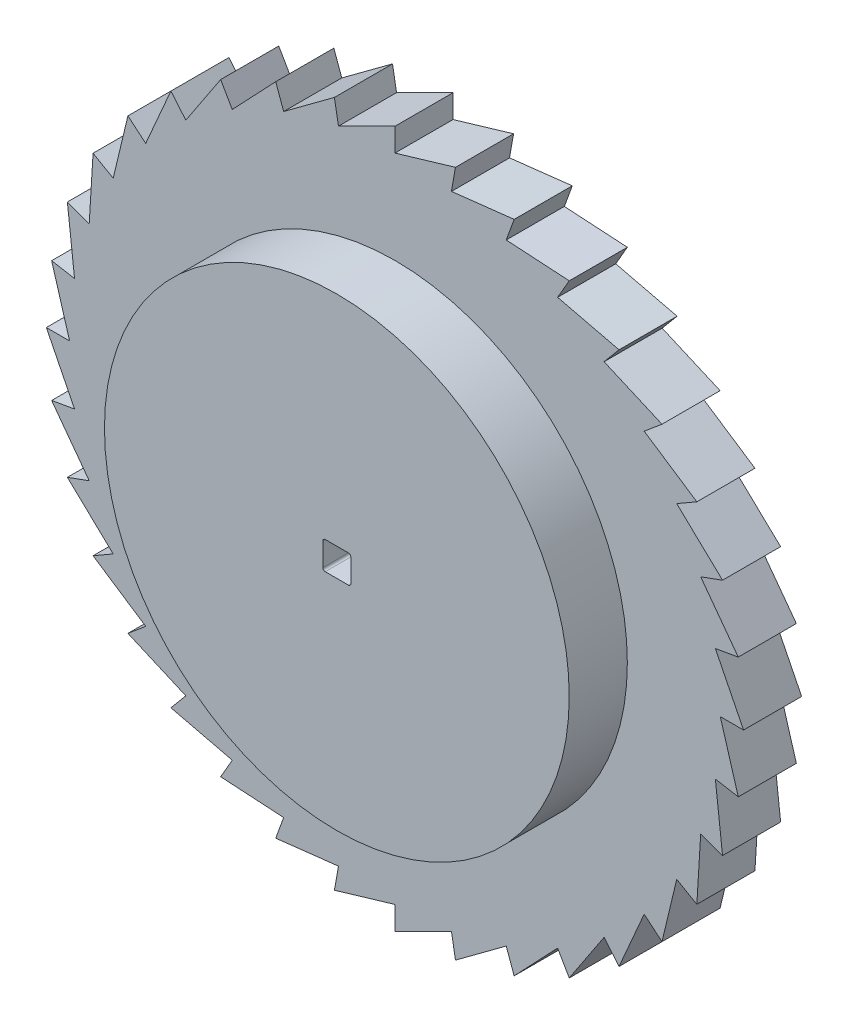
ISO-10303-21;
HEADER;
FILE_DESCRIPTION(('STEP AP214'),'2;1');
FILE_NAME('part.step','',(''),(''),'','','');
FILE_SCHEMA(('AUTOMOTIVE_DESIGN { 1 0 10303 214 1 1 1 1 }'));
ENDSEC;
DATA;
#1=APPLICATION_CONTEXT('core data for automotive mechanical design processes');
#2=APPLICATION_PROTOCOL_DEFINITION('international standard','automotive_design',2000,#1);
#3=PRODUCT_CONTEXT('',#1,'mechanical');
#4=PRODUCT('Part','Part','',(#3));
#5=PRODUCT_RELATED_PRODUCT_CATEGORY('part','',(#4));
#6=PRODUCT_DEFINITION_FORMATION('','',#4);
#7=PRODUCT_DEFINITION_CONTEXT('part definition',#1,'design');
#8=PRODUCT_DEFINITION('design','',#6,#7);
#9=PRODUCT_DEFINITION_SHAPE('','',#8);
#10=(LENGTH_UNIT() NAMED_UNIT(*) SI_UNIT(.MILLI.,.METRE.));
#11=(NAMED_UNIT(*) PLANE_ANGLE_UNIT() SI_UNIT($,.RADIAN.));
#12=(NAMED_UNIT(*) SI_UNIT($,.STERADIAN.) SOLID_ANGLE_UNIT());
#13=UNCERTAINTY_MEASURE_WITH_UNIT(LENGTH_MEASURE(1.E-05),#10,'distance_accuracy_value','');
#14=(GEOMETRIC_REPRESENTATION_CONTEXT(3) GLOBAL_UNCERTAINTY_ASSIGNED_CONTEXT((#13)) GLOBAL_UNIT_ASSIGNED_CONTEXT((#10,
#11,#12)) REPRESENTATION_CONTEXT('',''));
#15=CARTESIAN_POINT('',(0.,0.,0.));
#16=DIRECTION('',(0.,0.,1.));
#17=DIRECTION('',(1.,0.,0.));
#18=AXIS2_PLACEMENT_3D('',#15,#16,#17);
#19=CARTESIAN_POINT('',(6.17492919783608,35.0197636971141,6.35));
#20=DIRECTION('',(-0.98480775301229,0.173648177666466,0.));
#21=DIRECTION('',(-0.173648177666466,-0.98480775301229,0.));
#22=AXIS2_PLACEMENT_3D('',#19,#20,#21);
#23=PLANE('',#22);
#24=DIRECTION('',(0.173648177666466,0.98480775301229,0.));
#25=VECTOR('',#24,1.);
#26=CARTESIAN_POINT('',(6.17492919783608,35.0197636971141,0.));
#27=LINE('',#26,#25);
#28=CARTESIAN_POINT('',(6.17492919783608,35.0197636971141,0.));
#29=VERTEX_POINT('',#28);
#30=CARTESIAN_POINT('',(6.61599556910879,37.5211753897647,0.));
#31=VERTEX_POINT('',#30);
#32=EDGE_CURVE('E553',#29,#31,#27,.T.);
#33=ORIENTED_EDGE('',*,*,#32,.T.);
#34=DIRECTION('',(0.,0.,-1.));
#35=VECTOR('',#34,1.);
#36=CARTESIAN_POINT('',(6.61599556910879,37.5211753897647,6.35));
#37=LINE('',#36,#35);
#38=CARTESIAN_POINT('',(6.61599556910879,37.5211753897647,6.35));
#39=VERTEX_POINT('',#38);
#40=EDGE_CURVE('E534',#39,#31,#37,.T.);
#41=ORIENTED_EDGE('',*,*,#40,.F.);
#42=DIRECTION('',(0.173648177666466,0.98480775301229,0.));
#43=VECTOR('',#42,1.);
#44=CARTESIAN_POINT('',(6.17492919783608,35.0197636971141,6.35));
#45=LINE('',#44,#43);
#46=CARTESIAN_POINT('',(6.17492919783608,35.0197636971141,6.35));
#47=VERTEX_POINT('',#46);
#48=EDGE_CURVE('E541',#47,#39,#45,.T.);
#49=ORIENTED_EDGE('',*,*,#48,.F.);
#50=DIRECTION('',(0.,0.,-1.));
#51=VECTOR('',#50,1.);
#52=CARTESIAN_POINT('',(6.17492919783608,35.0197636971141,6.35));
#53=LINE('',#52,#51);
#54=EDGE_CURVE('E771',#47,#29,#53,.T.);
#55=ORIENTED_EDGE('',*,*,#54,.T.);
#56=EDGE_LOOP('',(#33,#41,#49,#55));
#57=FACE_BOUND('',#56,.T.);
#58=ADVANCED_FACE('F32',(#57),#23,.F.);
#59=CARTESIAN_POINT('',(0.,35.56,6.35));
#60=DIRECTION('',(0.284205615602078,-0.958763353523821,0.));
#61=DIRECTION('',(0.958763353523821,0.284205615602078,0.));
#62=AXIS2_PLACEMENT_3D('',#59,#60,#61);
#63=PLANE('',#62);
#64=DIRECTION('',(-0.958763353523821,-0.284205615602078,0.));
#65=VECTOR('',#64,1.);
#66=CARTESIAN_POINT('',(0.,35.56,0.));
#67=LINE('',#66,#65);
#68=CARTESIAN_POINT('',(0.,35.56,0.));
#69=VERTEX_POINT('',#68);
#70=EDGE_CURVE('E773',#31,#69,#67,.T.);
#71=ORIENTED_EDGE('',*,*,#70,.T.);
#72=DIRECTION('',(0.,0.,-1.));
#73=VECTOR('',#72,1.);
#74=CARTESIAN_POINT('',(0.,35.56,6.35));
#75=LINE('',#74,#73);
#76=CARTESIAN_POINT('',(0.,35.56,6.35));
#77=VERTEX_POINT('',#76);
#78=EDGE_CURVE('E537',#77,#69,#75,.T.);
#79=ORIENTED_EDGE('',*,*,#78,.F.);
#80=DIRECTION('',(-0.958763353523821,-0.284205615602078,0.));
#81=VECTOR('',#80,1.);
#82=CARTESIAN_POINT('',(0.,35.56,6.35));
#83=LINE('',#82,#81);
#84=EDGE_CURVE('E530',#39,#77,#83,.T.);
#85=ORIENTED_EDGE('',*,*,#84,.F.);
#86=ORIENTED_EDGE('',*,*,#40,.T.);
#87=EDGE_LOOP('',(#71,#79,#85,#86));
#88=FACE_BOUND('',#87,.T.);
#89=ADVANCED_FACE('F532',(#88),#63,.F.);
#90=CARTESIAN_POINT('',(0.,35.56,6.35));
#91=DIRECTION('',(-1.,-4.71570880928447E-13,0.));
#92=DIRECTION('',(4.71570880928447E-13,-1.,0.));
#93=AXIS2_PLACEMENT_3D('',#90,#91,#92);
#94=PLANE('',#93);
#95=DIRECTION('',(-4.71570880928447E-13,1.,0.));
#96=VECTOR('',#95,1.);
#97=CARTESIAN_POINT('',(0.,35.56,0.));
#98=LINE('',#97,#96);
#99=CARTESIAN_POINT('',(-1.19779003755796E-12,38.0999999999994,0.));
#100=VERTEX_POINT('',#99);
#101=EDGE_CURVE('E775',#69,#100,#98,.T.);
#102=ORIENTED_EDGE('',*,*,#101,.T.);
#103=DIRECTION('',(0.,0.,-1.));
#104=VECTOR('',#103,1.);
#105=CARTESIAN_POINT('',(-1.19779003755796E-12,38.0999999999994,6.35));
#106=LINE('',#105,#104);
#107=CARTESIAN_POINT('',(-1.19779003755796E-12,38.0999999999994,6.35));
#108=VERTEX_POINT('',#107);
#109=EDGE_CURVE('E558',#108,#100,#106,.T.);
#110=ORIENTED_EDGE('',*,*,#109,.F.);
#111=DIRECTION('',(-4.71570880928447E-13,1.,0.));
#112=VECTOR('',#111,1.);
#113=CARTESIAN_POINT('',(0.,35.56,6.35));
#114=LINE('',#113,#112);
#115=EDGE_CURVE('E540',#77,#108,#114,.T.);
#116=ORIENTED_EDGE('',*,*,#115,.F.);
#117=ORIENTED_EDGE('',*,*,#78,.T.);
#118=EDGE_LOOP('',(#102,#110,#116,#117));
#119=FACE_BOUND('',#118,.T.);
#120=ADVANCED_FACE('F1140',(#119),#94,.F.);
#121=CARTESIAN_POINT('',(-6.17492919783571,35.0197636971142,6.35));
#122=DIRECTION('',(0.446375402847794,-0.894845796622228,0.));
#123=DIRECTION('',(0.894845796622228,0.446375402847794,0.));
#124=AXIS2_PLACEMENT_3D('',#121,#122,#123);
#125=PLANE('',#124);
#126=DIRECTION('',(-0.894845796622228,-0.446375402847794,0.));
#127=VECTOR('',#126,1.);
#128=CARTESIAN_POINT('',(-6.17492919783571,35.0197636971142,0.));
#129=LINE('',#128,#127);
#130=CARTESIAN_POINT('',(-6.17492919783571,35.0197636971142,0.));
#131=VERTEX_POINT('',#130);
#132=EDGE_CURVE('E777',#100,#131,#129,.T.);
#133=ORIENTED_EDGE('',*,*,#132,.T.);
#134=DIRECTION('',(0.,0.,-1.));
#135=VECTOR('',#134,1.);
#136=CARTESIAN_POINT('',(-6.17492919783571,35.0197636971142,6.35));
#137=LINE('',#136,#135);
#138=CARTESIAN_POINT('',(-6.17492919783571,35.0197636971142,6.35));
#139=VERTEX_POINT('',#138);
#140=EDGE_CURVE('E1116',#139,#131,#137,.T.);
#141=ORIENTED_EDGE('',*,*,#140,.F.);
#142=DIRECTION('',(-0.894845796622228,-0.446375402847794,0.));
#143=VECTOR('',#142,1.);
#144=CARTESIAN_POINT('',(-6.17492919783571,35.0197636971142,6.35));
#145=LINE('',#144,#143);
#146=EDGE_CURVE('E634',#108,#139,#145,.T.);
#147=ORIENTED_EDGE('',*,*,#146,.F.);
#148=ORIENTED_EDGE('',*,*,#109,.T.);
#149=EDGE_LOOP('',(#133,#141,#147,#148));
#150=FACE_BOUND('',#149,.T.);
#151=ADVANCED_FACE('F1123',(#150),#125,.F.);
#152=CARTESIAN_POINT('',(-6.17492919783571,35.0197636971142,6.35));
#153=DIRECTION('',(-0.984807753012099,-0.173648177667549,0.));
#154=DIRECTION('',(0.173648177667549,-0.984807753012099,0.));
#155=AXIS2_PLACEMENT_3D('',#152,#153,#154);
#156=PLANE('',#155);
#157=DIRECTION('',(-0.173648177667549,0.984807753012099,0.));
#158=VECTOR('',#157,1.);
#159=CARTESIAN_POINT('',(-6.17492919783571,35.0197636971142,0.));
#160=LINE('',#159,#158);
#161=CARTESIAN_POINT('',(-6.61599556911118,37.5211753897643,0.));
#162=VERTEX_POINT('',#161);
#163=EDGE_CURVE('E779',#131,#162,#160,.T.);
#164=ORIENTED_EDGE('',*,*,#163,.T.);
#165=DIRECTION('',(0.,0.,-1.));
#166=VECTOR('',#165,1.);
#167=CARTESIAN_POINT('',(-6.61599556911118,37.5211753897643,6.35));
#168=LINE('',#167,#166);
#169=CARTESIAN_POINT('',(-6.61599556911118,37.5211753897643,6.35));
#170=VERTEX_POINT('',#169);
#171=EDGE_CURVE('E1113',#170,#162,#168,.T.);
#172=ORIENTED_EDGE('',*,*,#171,.F.);
#173=DIRECTION('',(-0.173648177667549,0.984807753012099,0.));
#174=VECTOR('',#173,1.);
#175=CARTESIAN_POINT('',(-6.17492919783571,35.0197636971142,6.35));
#176=LINE('',#175,#174);
#177=EDGE_CURVE('E636',#139,#170,#176,.T.);
#178=ORIENTED_EDGE('',*,*,#177,.F.);
#179=ORIENTED_EDGE('',*,*,#140,.T.);
#180=EDGE_LOOP('',(#164,#172,#178,#179));
#181=FACE_BOUND('',#180,.T.);
#182=ADVANCED_FACE('F1132',(#181),#156,.F.);
#183=CARTESIAN_POINT('',(-12.1622362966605,33.415469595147,6.35));
#184=DIRECTION('',(0.594982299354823,-0.80373880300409,0.));
#185=DIRECTION('',(0.80373880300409,0.594982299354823,0.));
#186=AXIS2_PLACEMENT_3D('',#183,#184,#185);
#187=PLANE('',#186);
#188=DIRECTION('',(-0.80373880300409,-0.594982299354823,0.));
#189=VECTOR('',#188,1.);
#190=CARTESIAN_POINT('',(-12.1622362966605,33.415469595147,0.));
#191=LINE('',#190,#189);
#192=CARTESIAN_POINT('',(-12.1622362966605,33.415469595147,0.));
#193=VERTEX_POINT('',#192);
#194=EDGE_CURVE('E781',#162,#193,#191,.T.);
#195=ORIENTED_EDGE('',*,*,#194,.T.);
#196=DIRECTION('',(0.,0.,-1.));
#197=VECTOR('',#196,1.);
#198=CARTESIAN_POINT('',(-12.1622362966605,33.415469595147,6.35));
#199=LINE('',#198,#197);
#200=CARTESIAN_POINT('',(-12.1622362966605,33.415469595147,6.35));
#201=VERTEX_POINT('',#200);
#202=EDGE_CURVE('E1110',#201,#193,#199,.T.);
#203=ORIENTED_EDGE('',*,*,#202,.F.);
#204=DIRECTION('',(-0.80373880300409,-0.594982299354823,0.));
#205=VECTOR('',#204,1.);
#206=CARTESIAN_POINT('',(-12.1622362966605,33.415469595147,6.35));
#207=LINE('',#206,#205);
#208=EDGE_CURVE('E638',#170,#201,#207,.T.);
#209=ORIENTED_EDGE('',*,*,#208,.F.);
#210=ORIENTED_EDGE('',*,*,#171,.T.);
#211=EDGE_LOOP('',(#195,#203,#209,#210));
#212=FACE_BOUND('',#211,.T.);
#213=ADVANCED_FACE('F1136',(#212),#187,.F.);
#214=CARTESIAN_POINT('',(-12.1622362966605,33.415469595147,6.35));
#215=DIRECTION('',(-0.93969262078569,-0.342020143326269,0.));
#216=DIRECTION('',(0.342020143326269,-0.93969262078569,0.));
#217=AXIS2_PLACEMENT_3D('',#214,#215,#216);
#218=PLANE('',#217);
#219=DIRECTION('',(-0.342020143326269,0.93969262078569,0.));
#220=VECTOR('',#219,1.);
#221=CARTESIAN_POINT('',(-12.1622362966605,33.415469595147,0.));
#222=LINE('',#221,#220);
#223=CARTESIAN_POINT('',(-13.030967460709,35.8022888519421,0.));
#224=VERTEX_POINT('',#223);
#225=EDGE_CURVE('E783',#193,#224,#222,.T.);
#226=ORIENTED_EDGE('',*,*,#225,.T.);
#227=DIRECTION('',(0.,0.,-1.));
#228=VECTOR('',#227,1.);
#229=CARTESIAN_POINT('',(-13.030967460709,35.8022888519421,6.35));
#230=LINE('',#229,#228);
#231=CARTESIAN_POINT('',(-13.030967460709,35.8022888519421,6.35));
#232=VERTEX_POINT('',#231);
#233=EDGE_CURVE('E1107',#232,#224,#230,.T.);
#234=ORIENTED_EDGE('',*,*,#233,.F.);
#235=DIRECTION('',(-0.342020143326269,0.93969262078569,0.));
#236=VECTOR('',#235,1.);
#237=CARTESIAN_POINT('',(-12.1622362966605,33.415469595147,6.35));
#238=LINE('',#237,#236);
#239=EDGE_CURVE('E640',#201,#232,#238,.T.);
#240=ORIENTED_EDGE('',*,*,#239,.F.);
#241=ORIENTED_EDGE('',*,*,#202,.T.);
#242=EDGE_LOOP('',(#226,#234,#240,#241));
#243=FACE_BOUND('',#242,.T.);
#244=ADVANCED_FACE('F1461',(#243),#218,.F.);
#245=CARTESIAN_POINT('',(-17.7799999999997,30.7958633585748,6.35));
#246=DIRECTION('',(0.725510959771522,-0.688210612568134,0.));
#247=DIRECTION('',(0.688210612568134,0.725510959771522,0.));
#248=AXIS2_PLACEMENT_3D('',#245,#246,#247);
#249=PLANE('',#248);
#250=DIRECTION('',(-0.688210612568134,-0.725510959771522,0.));
#251=VECTOR('',#250,1.);
#252=CARTESIAN_POINT('',(-17.7799999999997,30.7958633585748,0.));
#253=LINE('',#252,#251);
#254=CARTESIAN_POINT('',(-17.7799999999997,30.7958633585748,0.));
#255=VERTEX_POINT('',#254);
#256=EDGE_CURVE('E785',#224,#255,#253,.T.);
#257=ORIENTED_EDGE('',*,*,#256,.T.);
#258=DIRECTION('',(0.,0.,-1.));
#259=VECTOR('',#258,1.);
#260=CARTESIAN_POINT('',(-17.7799999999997,30.7958633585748,6.35));
#261=LINE('',#260,#259);
#262=CARTESIAN_POINT('',(-17.7799999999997,30.7958633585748,6.35));
#263=VERTEX_POINT('',#262);
#264=EDGE_CURVE('E1104',#263,#255,#261,.T.);
#265=ORIENTED_EDGE('',*,*,#264,.F.);
#266=DIRECTION('',(-0.688210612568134,-0.725510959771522,0.));
#267=VECTOR('',#266,1.);
#268=CARTESIAN_POINT('',(-17.7799999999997,30.7958633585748,6.35));
#269=LINE('',#268,#267);
#270=EDGE_CURVE('E642',#232,#263,#269,.T.);
#271=ORIENTED_EDGE('',*,*,#270,.F.);
#272=ORIENTED_EDGE('',*,*,#233,.T.);
#273=EDGE_LOOP('',(#257,#265,#271,#272));
#274=FACE_BOUND('',#273,.T.);
#275=ADVANCED_FACE('F1457',(#274),#249,.F.);
#276=CARTESIAN_POINT('',(-17.7799999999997,30.7958633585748,6.35));
#277=DIRECTION('',(-0.866025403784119,-0.500000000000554,0.));
#278=DIRECTION('',(0.500000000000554,-0.866025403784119,0.));
#279=AXIS2_PLACEMENT_3D('',#276,#277,#278);
#280=PLANE('',#279);
#281=DIRECTION('',(-0.500000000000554,0.866025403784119,0.));
#282=VECTOR('',#281,1.);
#283=CARTESIAN_POINT('',(-17.7799999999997,30.7958633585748,0.));
#284=LINE('',#283,#282);
#285=CARTESIAN_POINT('',(-19.0500000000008,32.9955678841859,0.));
#286=VERTEX_POINT('',#285);
#287=EDGE_CURVE('E787',#255,#286,#284,.T.);
#288=ORIENTED_EDGE('',*,*,#287,.T.);
#289=DIRECTION('',(0.,0.,-1.));
#290=VECTOR('',#289,1.);
#291=CARTESIAN_POINT('',(-19.0500000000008,32.9955678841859,6.35));
#292=LINE('',#291,#290);
#293=CARTESIAN_POINT('',(-19.0500000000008,32.9955678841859,6.35));
#294=VERTEX_POINT('',#293);
#295=EDGE_CURVE('E1101',#294,#286,#292,.T.);
#296=ORIENTED_EDGE('',*,*,#295,.F.);
#297=DIRECTION('',(-0.500000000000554,0.866025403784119,0.));
#298=VECTOR('',#297,1.);
#299=CARTESIAN_POINT('',(-17.7799999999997,30.7958633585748,6.35));
#300=LINE('',#299,#298);
#301=EDGE_CURVE('E644',#263,#294,#300,.T.);
#302=ORIENTED_EDGE('',*,*,#301,.F.);
#303=ORIENTED_EDGE('',*,*,#264,.T.);
#304=EDGE_LOOP('',(#288,#296,#302,#303));
#305=FACE_BOUND('',#304,.T.);
#306=ADVANCED_FACE('F1453',(#305),#280,.F.);
#307=CARTESIAN_POINT('',(-22.8575274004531,27.2405403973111,6.35));
#308=DIRECTION('',(0.833995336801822,-0.551771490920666,0.));
#309=DIRECTION('',(0.551771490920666,0.833995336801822,0.));
#310=AXIS2_PLACEMENT_3D('',#307,#308,#309);
#311=PLANE('',#310);
#312=DIRECTION('',(-0.551771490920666,-0.833995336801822,0.));
#313=VECTOR('',#312,1.);
#314=CARTESIAN_POINT('',(-22.8575274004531,27.2405403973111,0.));
#315=LINE('',#314,#313);
#316=CARTESIAN_POINT('',(-22.8575274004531,27.2405403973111,0.));
#317=VERTEX_POINT('',#316);
#318=EDGE_CURVE('E789',#286,#317,#315,.T.);
#319=ORIENTED_EDGE('',*,*,#318,.T.);
#320=DIRECTION('',(0.,0.,-1.));
#321=VECTOR('',#320,1.);
#322=CARTESIAN_POINT('',(-22.8575274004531,27.2405403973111,6.35));
#323=LINE('',#322,#321);
#324=CARTESIAN_POINT('',(-22.8575274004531,27.2405403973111,6.35));
#325=VERTEX_POINT('',#324);
#326=EDGE_CURVE('E1098',#325,#317,#323,.T.);
#327=ORIENTED_EDGE('',*,*,#326,.F.);
#328=DIRECTION('',(-0.551771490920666,-0.833995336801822,0.));
#329=VECTOR('',#328,1.);
#330=CARTESIAN_POINT('',(-22.8575274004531,27.2405403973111,6.35));
#331=LINE('',#330,#329);
#332=EDGE_CURVE('E646',#294,#325,#331,.T.);
#333=ORIENTED_EDGE('',*,*,#332,.F.);
#334=ORIENTED_EDGE('',*,*,#295,.T.);
#335=EDGE_LOOP('',(#319,#327,#333,#334));
#336=FACE_BOUND('',#335,.T.);
#337=ADVANCED_FACE('F1449',(#336),#311,.F.);
#338=CARTESIAN_POINT('',(-22.8575274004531,27.2405403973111,6.35));
#339=DIRECTION('',(-0.76604444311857,-0.642787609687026,0.));
#340=DIRECTION('',(0.642787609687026,-0.76604444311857,0.));
#341=AXIS2_PLACEMENT_3D('',#338,#339,#340);
#342=PLANE('',#341);
#343=DIRECTION('',(-0.642787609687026,0.76604444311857,0.));
#344=VECTOR('',#343,1.);
#345=CARTESIAN_POINT('',(-22.8575274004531,27.2405403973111,0.));
#346=LINE('',#345,#344);
#347=CARTESIAN_POINT('',(-24.4902079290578,29.1862932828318,0.));
#348=VERTEX_POINT('',#347);
#349=EDGE_CURVE('E791',#317,#348,#346,.T.);
#350=ORIENTED_EDGE('',*,*,#349,.T.);
#351=DIRECTION('',(0.,0.,-1.));
#352=VECTOR('',#351,1.);
#353=CARTESIAN_POINT('',(-24.4902079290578,29.1862932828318,6.35));
#354=LINE('',#353,#352);
#355=CARTESIAN_POINT('',(-24.4902079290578,29.1862932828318,6.35));
#356=VERTEX_POINT('',#355);
#357=EDGE_CURVE('E1095',#356,#348,#354,.T.);
#358=ORIENTED_EDGE('',*,*,#357,.F.);
#359=DIRECTION('',(-0.642787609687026,0.76604444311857,0.));
#360=VECTOR('',#359,1.);
#361=CARTESIAN_POINT('',(-22.8575274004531,27.2405403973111,6.35));
#362=LINE('',#361,#360);
#363=EDGE_CURVE('E648',#325,#356,#362,.T.);
#364=ORIENTED_EDGE('',*,*,#363,.F.);
#365=ORIENTED_EDGE('',*,*,#326,.T.);
#366=EDGE_LOOP('',(#350,#358,#364,#365));
#367=FACE_BOUND('',#366,.T.);
#368=ADVANCED_FACE('F1445',(#367),#342,.F.);
#369=CARTESIAN_POINT('',(-27.2405403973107,22.8575274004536,6.35));
#370=DIRECTION('',(0.917139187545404,-0.398567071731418,0.));
#371=DIRECTION('',(0.398567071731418,0.917139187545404,0.));
#372=AXIS2_PLACEMENT_3D('',#369,#370,#371);
#373=PLANE('',#372);
#374=DIRECTION('',(-0.398567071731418,-0.917139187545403,0.));
#375=VECTOR('',#374,1.);
#376=CARTESIAN_POINT('',(-27.2405403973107,22.8575274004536,0.));
#377=LINE('',#376,#375);
#378=CARTESIAN_POINT('',(-27.2405403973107,22.8575274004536,0.));
#379=VERTEX_POINT('',#378);
#380=EDGE_CURVE('E793',#348,#379,#377,.T.);
#381=ORIENTED_EDGE('',*,*,#380,.T.);
#382=DIRECTION('',(0.,0.,-1.));
#383=VECTOR('',#382,1.);
#384=CARTESIAN_POINT('',(-27.2405403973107,22.8575274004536,6.35));
#385=LINE('',#384,#383);
#386=CARTESIAN_POINT('',(-27.2405403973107,22.8575274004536,6.35));
#387=VERTEX_POINT('',#386);
#388=EDGE_CURVE('E1092',#387,#379,#385,.T.);
#389=ORIENTED_EDGE('',*,*,#388,.F.);
#390=DIRECTION('',(-0.398567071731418,-0.917139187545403,0.));
#391=VECTOR('',#390,1.);
#392=CARTESIAN_POINT('',(-27.2405403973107,22.8575274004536,6.35));
#393=LINE('',#392,#391);
#394=EDGE_CURVE('E650',#356,#387,#393,.T.);
#395=ORIENTED_EDGE('',*,*,#394,.F.);
#396=ORIENTED_EDGE('',*,*,#357,.T.);
#397=EDGE_LOOP('',(#381,#389,#395,#396));
#398=FACE_BOUND('',#397,.T.);
#399=ADVANCED_FACE('F1441',(#398),#373,.F.);
#400=CARTESIAN_POINT('',(-27.2405403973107,22.8575274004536,6.35));
#401=DIRECTION('',(-0.642787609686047,-0.766044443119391,0.));
#402=DIRECTION('',(0.766044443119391,-0.642787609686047,0.));
#403=AXIS2_PLACEMENT_3D('',#400,#401,#402);
#404=PLANE('',#403);
#405=DIRECTION('',(-0.766044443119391,0.642787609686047,0.));
#406=VECTOR('',#405,1.);
#407=CARTESIAN_POINT('',(-27.2405403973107,22.8575274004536,0.));
#408=LINE('',#407,#406);
#409=CARTESIAN_POINT('',(-29.1862932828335,24.4902079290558,0.));
#410=VERTEX_POINT('',#409);
#411=EDGE_CURVE('E795',#379,#410,#408,.T.);
#412=ORIENTED_EDGE('',*,*,#411,.T.);
#413=DIRECTION('',(0.,0.,-1.));
#414=VECTOR('',#413,1.);
#415=CARTESIAN_POINT('',(-29.1862932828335,24.4902079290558,6.35));
#416=LINE('',#415,#414);
#417=CARTESIAN_POINT('',(-29.1862932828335,24.4902079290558,6.35));
#418=VERTEX_POINT('',#417);
#419=EDGE_CURVE('E1089',#418,#410,#416,.T.);
#420=ORIENTED_EDGE('',*,*,#419,.F.);
#421=DIRECTION('',(-0.766044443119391,0.642787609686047,0.));
#422=VECTOR('',#421,1.);
#423=CARTESIAN_POINT('',(-27.2405403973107,22.8575274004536,6.35));
#424=LINE('',#423,#422);
#425=EDGE_CURVE('E652',#387,#418,#424,.T.);
#426=ORIENTED_EDGE('',*,*,#425,.F.);
#427=ORIENTED_EDGE('',*,*,#388,.T.);
#428=EDGE_LOOP('',(#412,#420,#426,#427));
#429=FACE_BOUND('',#428,.T.);
#430=ADVANCED_FACE('F1437',(#429),#404,.F.);
#431=CARTESIAN_POINT('',(-30.7958633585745,17.7800000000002,6.35));
#432=DIRECTION('',(0.972416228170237,-0.233252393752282,0.));
#433=DIRECTION('',(0.233252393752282,0.972416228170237,0.));
#434=AXIS2_PLACEMENT_3D('',#431,#432,#433);
#435=PLANE('',#434);
#436=DIRECTION('',(-0.233252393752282,-0.972416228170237,0.));
#437=VECTOR('',#436,1.);
#438=CARTESIAN_POINT('',(-30.7958633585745,17.7800000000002,0.));
#439=LINE('',#438,#437);
#440=CARTESIAN_POINT('',(-30.7958633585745,17.7800000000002,0.));
#441=VERTEX_POINT('',#440);
#442=EDGE_CURVE('E797',#410,#441,#439,.T.);
#443=ORIENTED_EDGE('',*,*,#442,.T.);
#444=DIRECTION('',(0.,0.,-1.));
#445=VECTOR('',#444,1.);
#446=CARTESIAN_POINT('',(-30.7958633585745,17.7800000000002,6.35));
#447=LINE('',#446,#445);
#448=CARTESIAN_POINT('',(-30.7958633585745,17.7800000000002,6.35));
#449=VERTEX_POINT('',#448);
#450=EDGE_CURVE('E1086',#449,#441,#447,.T.);
#451=ORIENTED_EDGE('',*,*,#450,.F.);
#452=DIRECTION('',(-0.233252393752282,-0.972416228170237,0.));
#453=VECTOR('',#452,1.);
#454=CARTESIAN_POINT('',(-30.7958633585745,17.7800000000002,6.35));
#455=LINE('',#454,#453);
#456=EDGE_CURVE('E654',#418,#449,#455,.T.);
#457=ORIENTED_EDGE('',*,*,#456,.F.);
#458=ORIENTED_EDGE('',*,*,#419,.T.);
#459=EDGE_LOOP('',(#443,#451,#457,#458));
#460=FACE_BOUND('',#459,.T.);
#461=ADVANCED_FACE('F1433',(#460),#435,.F.);
#462=CARTESIAN_POINT('',(-30.7958633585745,17.7800000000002,6.35));
#463=DIRECTION('',(-0.499999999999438,-0.866025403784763,0.));
#464=DIRECTION('',(0.866025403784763,-0.499999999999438,0.));
#465=AXIS2_PLACEMENT_3D('',#462,#463,#464);
#466=PLANE('',#465);
#467=DIRECTION('',(-0.866025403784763,0.499999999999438,0.));
#468=VECTOR('',#467,1.);
#469=CARTESIAN_POINT('',(-30.7958633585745,17.7800000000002,0.));
#470=LINE('',#469,#468);
#471=CARTESIAN_POINT('',(-32.9955678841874,19.0499999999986,0.));
#472=VERTEX_POINT('',#471);
#473=EDGE_CURVE('E799',#441,#472,#470,.T.);
#474=ORIENTED_EDGE('',*,*,#473,.T.);
#475=DIRECTION('',(0.,0.,-1.));
#476=VECTOR('',#475,1.);
#477=CARTESIAN_POINT('',(-32.9955678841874,19.0499999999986,6.35));
#478=LINE('',#477,#476);
#479=CARTESIAN_POINT('',(-32.9955678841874,19.0499999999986,6.35));
#480=VERTEX_POINT('',#479);
#481=EDGE_CURVE('E1083',#480,#472,#478,.T.);
#482=ORIENTED_EDGE('',*,*,#481,.F.);
#483=DIRECTION('',(-0.866025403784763,0.499999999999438,0.));
#484=VECTOR('',#483,1.);
#485=CARTESIAN_POINT('',(-30.7958633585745,17.7800000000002,6.35));
#486=LINE('',#485,#484);
#487=EDGE_CURVE('E656',#449,#480,#486,.T.);
#488=ORIENTED_EDGE('',*,*,#487,.F.);
#489=ORIENTED_EDGE('',*,*,#450,.T.);
#490=EDGE_LOOP('',(#474,#482,#488,#489));
#491=FACE_BOUND('',#490,.T.);
#492=ADVANCED_FACE('F1429',(#491),#466,.F.);
#493=CARTESIAN_POINT('',(-33.4154695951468,12.162236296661,6.35));
#494=DIRECTION('',(0.998146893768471,-0.0608504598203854,0.));
#495=DIRECTION('',(0.0608504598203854,0.998146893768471,0.));
#496=AXIS2_PLACEMENT_3D('',#493,#494,#495);
#497=PLANE('',#496);
#498=DIRECTION('',(-0.0608504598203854,-0.998146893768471,0.));
#499=VECTOR('',#498,1.);
#500=CARTESIAN_POINT('',(-33.4154695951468,12.162236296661,0.));
#501=LINE('',#500,#499);
#502=CARTESIAN_POINT('',(-33.4154695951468,12.162236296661,0.));
#503=VERTEX_POINT('',#502);
#504=EDGE_CURVE('E801',#472,#503,#501,.T.);
#505=ORIENTED_EDGE('',*,*,#504,.T.);
#506=DIRECTION('',(0.,0.,-1.));
#507=VECTOR('',#506,1.);
#508=CARTESIAN_POINT('',(-33.4154695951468,12.162236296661,6.35));
#509=LINE('',#508,#507);
#510=CARTESIAN_POINT('',(-33.4154695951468,12.162236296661,6.35));
#511=VERTEX_POINT('',#510);
#512=EDGE_CURVE('E1080',#511,#503,#509,.T.);
#513=ORIENTED_EDGE('',*,*,#512,.F.);
#514=DIRECTION('',(-0.0608504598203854,-0.998146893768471,0.));
#515=VECTOR('',#514,1.);
#516=CARTESIAN_POINT('',(-33.4154695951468,12.162236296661,6.35));
#517=LINE('',#516,#515);
#518=EDGE_CURVE('E658',#480,#511,#517,.T.);
#519=ORIENTED_EDGE('',*,*,#518,.F.);
#520=ORIENTED_EDGE('',*,*,#481,.T.);
#521=EDGE_LOOP('',(#505,#513,#519,#520));
#522=FACE_BOUND('',#521,.T.);
#523=ADVANCED_FACE('F1425',(#522),#497,.F.);
#524=CARTESIAN_POINT('',(-33.4154695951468,12.162236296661,6.35));
#525=DIRECTION('',(-0.342020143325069,-0.939692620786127,0.));
#526=DIRECTION('',(0.939692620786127,-0.342020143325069,0.));
#527=AXIS2_PLACEMENT_3D('',#524,#525,#526);
#528=PLANE('',#527);
#529=DIRECTION('',(-0.939692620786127,0.342020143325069,0.));
#530=VECTOR('',#529,1.);
#531=CARTESIAN_POINT('',(-33.4154695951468,12.162236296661,0.));
#532=LINE('',#531,#530);
#533=CARTESIAN_POINT('',(-35.8022888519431,13.0309674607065,0.));
#534=VERTEX_POINT('',#533);
#535=EDGE_CURVE('E803',#503,#534,#532,.T.);
#536=ORIENTED_EDGE('',*,*,#535,.T.);
#537=DIRECTION('',(0.,0.,-1.));
#538=VECTOR('',#537,1.);
#539=CARTESIAN_POINT('',(-35.8022888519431,13.0309674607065,6.35));
#540=LINE('',#539,#538);
#541=CARTESIAN_POINT('',(-35.8022888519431,13.0309674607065,6.35));
#542=VERTEX_POINT('',#541);
#543=EDGE_CURVE('E1077',#542,#534,#540,.T.);
#544=ORIENTED_EDGE('',*,*,#543,.F.);
#545=DIRECTION('',(-0.939692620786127,0.342020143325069,0.));
#546=VECTOR('',#545,1.);
#547=CARTESIAN_POINT('',(-33.4154695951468,12.162236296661,6.35));
#548=LINE('',#547,#546);
#549=EDGE_CURVE('E660',#511,#542,#548,.T.);
#550=ORIENTED_EDGE('',*,*,#549,.F.);
#551=ORIENTED_EDGE('',*,*,#512,.T.);
#552=EDGE_LOOP('',(#536,#544,#550,#551));
#553=FACE_BOUND('',#552,.T.);
#554=ADVANCED_FACE('F1421',(#553),#528,.F.);
#555=CARTESIAN_POINT('',(-35.0197636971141,6.1749291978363,6.35));
#556=DIRECTION('',(0.993549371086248,0.113400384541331,0.));
#557=DIRECTION('',(-0.113400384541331,0.993549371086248,0.));
#558=AXIS2_PLACEMENT_3D('',#555,#556,#557);
#559=PLANE('',#558);
#560=DIRECTION('',(0.113400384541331,-0.993549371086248,0.));
#561=VECTOR('',#560,1.);
#562=CARTESIAN_POINT('',(-35.0197636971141,6.1749291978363,0.));
#563=LINE('',#562,#561);
#564=CARTESIAN_POINT('',(-35.0197636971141,6.1749291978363,0.));
#565=VERTEX_POINT('',#564);
#566=EDGE_CURVE('E805',#534,#565,#563,.T.);
#567=ORIENTED_EDGE('',*,*,#566,.T.);
#568=DIRECTION('',(0.,0.,-1.));
#569=VECTOR('',#568,1.);
#570=CARTESIAN_POINT('',(-35.0197636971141,6.1749291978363,6.35));
#571=LINE('',#570,#569);
#572=CARTESIAN_POINT('',(-35.0197636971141,6.1749291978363,6.35));
#573=VERTEX_POINT('',#572);
#574=EDGE_CURVE('E1074',#573,#565,#571,.T.);
#575=ORIENTED_EDGE('',*,*,#574,.F.);
#576=DIRECTION('',(0.113400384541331,-0.993549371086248,0.));
#577=VECTOR('',#576,1.);
#578=CARTESIAN_POINT('',(-35.0197636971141,6.1749291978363,6.35));
#579=LINE('',#578,#577);
#580=EDGE_CURVE('E662',#542,#573,#579,.T.);
#581=ORIENTED_EDGE('',*,*,#580,.F.);
#582=ORIENTED_EDGE('',*,*,#543,.T.);
#583=EDGE_LOOP('',(#567,#575,#581,#582));
#584=FACE_BOUND('',#583,.T.);
#585=ADVANCED_FACE('F1417',(#584),#559,.F.);
#586=CARTESIAN_POINT('',(-35.0197636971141,6.1749291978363,6.35));
#587=DIRECTION('',(-0.173648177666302,-0.984807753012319,0.));
#588=DIRECTION('',(0.984807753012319,-0.173648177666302,0.));
#589=AXIS2_PLACEMENT_3D('',#586,#587,#588);
#590=PLANE('',#589);
#591=DIRECTION('',(-0.984807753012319,0.173648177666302,0.));
#592=VECTOR('',#591,1.);
#593=CARTESIAN_POINT('',(-35.0197636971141,6.1749291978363,0.));
#594=LINE('',#593,#592);
#595=CARTESIAN_POINT('',(-37.5211753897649,6.61599556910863,0.));
#596=VERTEX_POINT('',#595);
#597=EDGE_CURVE('E807',#565,#596,#594,.T.);
#598=ORIENTED_EDGE('',*,*,#597,.T.);
#599=DIRECTION('',(0.,0.,-1.));
#600=VECTOR('',#599,1.);
#601=CARTESIAN_POINT('',(-37.5211753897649,6.61599556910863,6.35));
#602=LINE('',#601,#600);
#603=CARTESIAN_POINT('',(-37.5211753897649,6.61599556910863,6.35));
#604=VERTEX_POINT('',#603);
#605=EDGE_CURVE('E1071',#604,#596,#602,.T.);
#606=ORIENTED_EDGE('',*,*,#605,.F.);
#607=DIRECTION('',(-0.984807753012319,0.173648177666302,0.));
#608=VECTOR('',#607,1.);
#609=CARTESIAN_POINT('',(-35.0197636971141,6.1749291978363,6.35));
#610=LINE('',#609,#608);
#611=EDGE_CURVE('E664',#573,#604,#610,.T.);
#612=ORIENTED_EDGE('',*,*,#611,.F.);
#613=ORIENTED_EDGE('',*,*,#574,.T.);
#614=EDGE_LOOP('',(#598,#606,#612,#613));
#615=FACE_BOUND('',#614,.T.);
#616=ADVANCED_FACE('F1413',(#615),#590,.F.);
#617=CARTESIAN_POINT('',(-35.56,2.35055030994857E-13,6.35));
#618=DIRECTION('',(0.958763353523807,0.284205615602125,0.));
#619=DIRECTION('',(-0.284205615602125,0.958763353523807,0.));
#620=AXIS2_PLACEMENT_3D('',#617,#618,#619);
#621=PLANE('',#620);
#622=DIRECTION('',(0.284205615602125,-0.958763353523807,0.));
#623=VECTOR('',#622,1.);
#624=CARTESIAN_POINT('',(-35.56,2.35055030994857E-13,0.));
#625=LINE('',#624,#623);
#626=CARTESIAN_POINT('',(-35.56,2.35055030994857E-13,0.));
#627=VERTEX_POINT('',#626);
#628=EDGE_CURVE('E809',#596,#627,#625,.T.);
#629=ORIENTED_EDGE('',*,*,#628,.T.);
#630=DIRECTION('',(0.,0.,-1.));
#631=VECTOR('',#630,1.);
#632=CARTESIAN_POINT('',(-35.56,2.35055030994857E-13,6.35));
#633=LINE('',#632,#631);
#634=CARTESIAN_POINT('',(-35.56,2.35055030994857E-13,6.35));
#635=VERTEX_POINT('',#634);
#636=EDGE_CURVE('E1068',#635,#627,#633,.T.);
#637=ORIENTED_EDGE('',*,*,#636,.F.);
#638=DIRECTION('',(0.284205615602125,-0.958763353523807,0.));
#639=VECTOR('',#638,1.);
#640=CARTESIAN_POINT('',(-35.56,2.35055030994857E-13,6.35));
#641=LINE('',#640,#639);
#642=EDGE_CURVE('E666',#604,#635,#641,.T.);
#643=ORIENTED_EDGE('',*,*,#642,.F.);
#644=ORIENTED_EDGE('',*,*,#605,.T.);
#645=EDGE_LOOP('',(#629,#637,#643,#644));
#646=FACE_BOUND('',#645,.T.);
#647=ADVANCED_FACE('F1409',(#646),#621,.F.);
#648=CARTESIAN_POINT('',(-35.56,2.35055030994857E-13,6.35));
#649=DIRECTION('',(6.23289249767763E-13,-1.,0.));
#650=DIRECTION('',(1.,6.23289249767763E-13,0.));
#651=AXIS2_PLACEMENT_3D('',#648,#649,#650);
#652=PLANE('',#651);
#653=DIRECTION('',(-1.,-6.23289249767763E-13,0.));
#654=VECTOR('',#653,1.);
#655=CARTESIAN_POINT('',(-35.56,2.35055030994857E-13,0.));
#656=LINE('',#655,#654);
#657=CARTESIAN_POINT('',(-38.0999999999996,-1.34809966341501E-12,0.));
#658=VERTEX_POINT('',#657);
#659=EDGE_CURVE('E811',#627,#658,#656,.T.);
#660=ORIENTED_EDGE('',*,*,#659,.T.);
#661=DIRECTION('',(0.,0.,-1.));
#662=VECTOR('',#661,1.);
#663=CARTESIAN_POINT('',(-38.0999999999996,-1.34809966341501E-12,6.35));
#664=LINE('',#663,#662);
#665=CARTESIAN_POINT('',(-38.0999999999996,-1.34809966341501E-12,6.35));
#666=VERTEX_POINT('',#665);
#667=EDGE_CURVE('E1065',#666,#658,#664,.T.);
#668=ORIENTED_EDGE('',*,*,#667,.F.);
#669=DIRECTION('',(-1.,-6.23289249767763E-13,0.));
#670=VECTOR('',#669,1.);
#671=CARTESIAN_POINT('',(-35.56,2.35055030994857E-13,6.35));
#672=LINE('',#671,#670);
#673=EDGE_CURVE('E668',#635,#666,#672,.T.);
#674=ORIENTED_EDGE('',*,*,#673,.F.);
#675=ORIENTED_EDGE('',*,*,#636,.T.);
#676=EDGE_LOOP('',(#660,#668,#674,#675));
#677=FACE_BOUND('',#676,.T.);
#678=ADVANCED_FACE('F1405',(#677),#652,.F.);
#679=CARTESIAN_POINT('',(-35.0197636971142,-6.17492919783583,6.35));
#680=DIRECTION('',(0.894845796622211,0.446375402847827,0.));
#681=DIRECTION('',(-0.446375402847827,0.894845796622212,0.));
#682=AXIS2_PLACEMENT_3D('',#679,#680,#681);
#683=PLANE('',#682);
#684=DIRECTION('',(0.446375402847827,-0.894845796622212,0.));
#685=VECTOR('',#684,1.);
#686=CARTESIAN_POINT('',(-35.0197636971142,-6.17492919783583,0.));
#687=LINE('',#686,#685);
#688=CARTESIAN_POINT('',(-35.0197636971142,-6.17492919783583,0.));
#689=VERTEX_POINT('',#688);
#690=EDGE_CURVE('E813',#658,#689,#687,.T.);
#691=ORIENTED_EDGE('',*,*,#690,.T.);
#692=DIRECTION('',(0.,0.,-1.));
#693=VECTOR('',#692,1.);
#694=CARTESIAN_POINT('',(-35.0197636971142,-6.17492919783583,6.35));
#695=LINE('',#694,#693);
#696=CARTESIAN_POINT('',(-35.0197636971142,-6.17492919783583,6.35));
#697=VERTEX_POINT('',#696);
#698=EDGE_CURVE('E1062',#697,#689,#695,.T.);
#699=ORIENTED_EDGE('',*,*,#698,.F.);
#700=DIRECTION('',(0.446375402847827,-0.894845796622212,0.));
#701=VECTOR('',#700,1.);
#702=CARTESIAN_POINT('',(-35.0197636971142,-6.17492919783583,6.35));
#703=LINE('',#702,#701);
#704=EDGE_CURVE('E670',#666,#697,#703,.T.);
#705=ORIENTED_EDGE('',*,*,#704,.F.);
#706=ORIENTED_EDGE('',*,*,#667,.T.);
#707=EDGE_LOOP('',(#691,#699,#705,#706));
#708=FACE_BOUND('',#707,.T.);
#709=ADVANCED_FACE('F1401',(#708),#683,.F.);
#710=CARTESIAN_POINT('',(-35.0197636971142,-6.17492919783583,6.35));
#711=DIRECTION('',(0.173648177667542,-0.9848077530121,0.));
#712=DIRECTION('',(0.9848077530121,0.173648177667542,0.));
#713=AXIS2_PLACEMENT_3D('',#710,#711,#712);
#714=PLANE('',#713);
#715=DIRECTION('',(-0.9848077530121,-0.173648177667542,0.));
#716=VECTOR('',#715,1.);
#717=CARTESIAN_POINT('',(-35.0197636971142,-6.17492919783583,0.));
#718=LINE('',#717,#716);
#719=CARTESIAN_POINT('',(-37.5211753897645,-6.61599556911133,0.));
#720=VERTEX_POINT('',#719);
#721=EDGE_CURVE('E815',#689,#720,#718,.T.);
#722=ORIENTED_EDGE('',*,*,#721,.T.);
#723=DIRECTION('',(0.,0.,-1.));
#724=VECTOR('',#723,1.);
#725=CARTESIAN_POINT('',(-37.5211753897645,-6.61599556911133,6.35));
#726=LINE('',#725,#724);
#727=CARTESIAN_POINT('',(-37.5211753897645,-6.61599556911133,6.35));
#728=VERTEX_POINT('',#727);
#729=EDGE_CURVE('E1059',#728,#720,#726,.T.);
#730=ORIENTED_EDGE('',*,*,#729,.F.);
#731=DIRECTION('',(-0.9848077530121,-0.173648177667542,0.));
#732=VECTOR('',#731,1.);
#733=CARTESIAN_POINT('',(-35.0197636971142,-6.17492919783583,6.35));
#734=LINE('',#733,#732);
#735=EDGE_CURVE('E672',#697,#728,#734,.T.);
#736=ORIENTED_EDGE('',*,*,#735,.F.);
#737=ORIENTED_EDGE('',*,*,#698,.T.);
#738=EDGE_LOOP('',(#722,#730,#736,#737));
#739=FACE_BOUND('',#738,.T.);
#740=ADVANCED_FACE('F1397',(#739),#714,.F.);
#741=CARTESIAN_POINT('',(-33.415469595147,-12.1622362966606,6.35));
#742=DIRECTION('',(0.803738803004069,0.594982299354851,0.));
#743=DIRECTION('',(-0.594982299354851,0.803738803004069,0.));
#744=AXIS2_PLACEMENT_3D('',#741,#742,#743);
#745=PLANE('',#744);
#746=DIRECTION('',(0.594982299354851,-0.803738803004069,0.));
#747=VECTOR('',#746,1.);
#748=CARTESIAN_POINT('',(-33.415469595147,-12.1622362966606,0.));
#749=LINE('',#748,#747);
#750=CARTESIAN_POINT('',(-33.415469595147,-12.1622362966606,0.));
#751=VERTEX_POINT('',#750);
#752=EDGE_CURVE('E817',#720,#751,#749,.T.);
#753=ORIENTED_EDGE('',*,*,#752,.T.);
#754=DIRECTION('',(0.,0.,-1.));
#755=VECTOR('',#754,1.);
#756=CARTESIAN_POINT('',(-33.415469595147,-12.1622362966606,6.35));
#757=LINE('',#756,#755);
#758=CARTESIAN_POINT('',(-33.415469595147,-12.1622362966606,6.35));
#759=VERTEX_POINT('',#758);
#760=EDGE_CURVE('E1056',#759,#751,#757,.T.);
#761=ORIENTED_EDGE('',*,*,#760,.F.);
#762=DIRECTION('',(0.594982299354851,-0.803738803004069,0.));
#763=VECTOR('',#762,1.);
#764=CARTESIAN_POINT('',(-33.415469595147,-12.1622362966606,6.35));
#765=LINE('',#764,#763);
#766=EDGE_CURVE('E674',#728,#759,#765,.T.);
#767=ORIENTED_EDGE('',*,*,#766,.F.);
#768=ORIENTED_EDGE('',*,*,#729,.T.);
#769=EDGE_LOOP('',(#753,#761,#767,#768));
#770=FACE_BOUND('',#769,.T.);
#771=ADVANCED_FACE('F1393',(#770),#745,.F.);
#772=CARTESIAN_POINT('',(-33.415469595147,-12.1622362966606,6.35));
#773=DIRECTION('',(0.342020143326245,-0.939692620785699,0.));
#774=DIRECTION('',(0.939692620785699,0.342020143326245,0.));
#775=AXIS2_PLACEMENT_3D('',#772,#773,#774);
#776=PLANE('',#775);
#777=DIRECTION('',(-0.939692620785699,-0.342020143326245,0.));
#778=VECTOR('',#777,1.);
#779=CARTESIAN_POINT('',(-33.415469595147,-12.1622362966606,0.));
#780=LINE('',#779,#778);
#781=CARTESIAN_POINT('',(-35.8022888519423,-13.0309674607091,0.));
#782=VERTEX_POINT('',#781);
#783=EDGE_CURVE('E819',#751,#782,#780,.T.);
#784=ORIENTED_EDGE('',*,*,#783,.T.);
#785=DIRECTION('',(0.,0.,-1.));
#786=VECTOR('',#785,1.);
#787=CARTESIAN_POINT('',(-35.8022888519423,-13.0309674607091,6.35));
#788=LINE('',#787,#786);
#789=CARTESIAN_POINT('',(-35.8022888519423,-13.0309674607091,6.35));
#790=VERTEX_POINT('',#789);
#791=EDGE_CURVE('E1053',#790,#782,#788,.T.);
#792=ORIENTED_EDGE('',*,*,#791,.F.);
#793=DIRECTION('',(-0.939692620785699,-0.342020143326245,0.));
#794=VECTOR('',#793,1.);
#795=CARTESIAN_POINT('',(-33.415469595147,-12.1622362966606,6.35));
#796=LINE('',#795,#794);
#797=EDGE_CURVE('E676',#759,#790,#796,.T.);
#798=ORIENTED_EDGE('',*,*,#797,.F.);
#799=ORIENTED_EDGE('',*,*,#760,.T.);
#800=EDGE_LOOP('',(#784,#792,#798,#799));
#801=FACE_BOUND('',#800,.T.);
#802=ADVANCED_FACE('F1389',(#801),#776,.F.);
#803=CARTESIAN_POINT('',(-30.7958633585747,-17.7799999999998,6.35));
#804=DIRECTION('',(0.688210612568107,0.725510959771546,0.));
#805=DIRECTION('',(-0.725510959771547,0.688210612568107,0.));
#806=AXIS2_PLACEMENT_3D('',#803,#804,#805);
#807=PLANE('',#806);
#808=DIRECTION('',(0.725510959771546,-0.688210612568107,0.));
#809=VECTOR('',#808,1.);
#810=CARTESIAN_POINT('',(-30.7958633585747,-17.7799999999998,0.));
#811=LINE('',#810,#809);
#812=CARTESIAN_POINT('',(-30.7958633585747,-17.7799999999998,0.));
#813=VERTEX_POINT('',#812);
#814=EDGE_CURVE('E821',#782,#813,#811,.T.);
#815=ORIENTED_EDGE('',*,*,#814,.T.);
#816=DIRECTION('',(0.,0.,-1.));
#817=VECTOR('',#816,1.);
#818=CARTESIAN_POINT('',(-30.7958633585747,-17.7799999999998,6.35));
#819=LINE('',#818,#817);
#820=CARTESIAN_POINT('',(-30.7958633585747,-17.7799999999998,6.35));
#821=VERTEX_POINT('',#820);
#822=EDGE_CURVE('E1050',#821,#813,#819,.T.);
#823=ORIENTED_EDGE('',*,*,#822,.F.);
#824=DIRECTION('',(0.725510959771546,-0.688210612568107,0.));
#825=VECTOR('',#824,1.);
#826=CARTESIAN_POINT('',(-30.7958633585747,-17.7799999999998,6.35));
#827=LINE('',#826,#825);
#828=EDGE_CURVE('E678',#790,#821,#827,.T.);
#829=ORIENTED_EDGE('',*,*,#828,.F.);
#830=ORIENTED_EDGE('',*,*,#791,.T.);
#831=EDGE_LOOP('',(#815,#823,#829,#830));
#832=FACE_BOUND('',#831,.T.);
#833=ADVANCED_FACE('F1385',(#832),#807,.F.);
#834=CARTESIAN_POINT('',(-30.7958633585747,-17.7799999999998,6.35));
#835=DIRECTION('',(0.500000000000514,-0.866025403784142,0.));
#836=DIRECTION('',(0.866025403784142,0.500000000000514,0.));
#837=AXIS2_PLACEMENT_3D('',#834,#835,#836);
#838=PLANE('',#837);
#839=DIRECTION('',(-0.866025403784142,-0.500000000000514,0.));
#840=VECTOR('',#839,1.);
#841=CARTESIAN_POINT('',(-30.7958633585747,-17.7799999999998,0.));
#842=LINE('',#841,#840);
#843=CARTESIAN_POINT('',(-32.9955678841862,-19.050000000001,0.));
#844=VERTEX_POINT('',#843);
#845=EDGE_CURVE('E823',#813,#844,#842,.T.);
#846=ORIENTED_EDGE('',*,*,#845,.T.);
#847=DIRECTION('',(0.,0.,-1.));
#848=VECTOR('',#847,1.);
#849=CARTESIAN_POINT('',(-32.9955678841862,-19.050000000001,6.35));
#850=LINE('',#849,#848);
#851=CARTESIAN_POINT('',(-32.9955678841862,-19.050000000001,6.35));
#852=VERTEX_POINT('',#851);
#853=EDGE_CURVE('E1047',#852,#844,#850,.T.);
#854=ORIENTED_EDGE('',*,*,#853,.F.);
#855=DIRECTION('',(-0.866025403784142,-0.500000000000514,0.));
#856=VECTOR('',#855,1.);
#857=CARTESIAN_POINT('',(-30.7958633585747,-17.7799999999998,6.35));
#858=LINE('',#857,#856);
#859=EDGE_CURVE('E680',#821,#852,#858,.T.);
#860=ORIENTED_EDGE('',*,*,#859,.F.);
#861=ORIENTED_EDGE('',*,*,#822,.T.);
#862=EDGE_LOOP('',(#846,#854,#860,#861));
#863=FACE_BOUND('',#862,.T.);
#864=ADVANCED_FACE('F1381',(#863),#838,.F.);
#865=CARTESIAN_POINT('',(-27.240540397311,-22.8575274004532,6.35));
#866=DIRECTION('',(0.551771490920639,0.833995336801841,0.));
#867=DIRECTION('',(-0.833995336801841,0.551771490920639,0.));
#868=AXIS2_PLACEMENT_3D('',#865,#866,#867);
#869=PLANE('',#868);
#870=DIRECTION('',(0.833995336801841,-0.551771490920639,0.));
#871=VECTOR('',#870,1.);
#872=CARTESIAN_POINT('',(-27.240540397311,-22.8575274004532,0.));
#873=LINE('',#872,#871);
#874=CARTESIAN_POINT('',(-27.240540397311,-22.8575274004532,0.));
#875=VERTEX_POINT('',#874);
#876=EDGE_CURVE('E825',#844,#875,#873,.T.);
#877=ORIENTED_EDGE('',*,*,#876,.T.);
#878=DIRECTION('',(0.,0.,-1.));
#879=VECTOR('',#878,1.);
#880=CARTESIAN_POINT('',(-27.240540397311,-22.8575274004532,6.35));
#881=LINE('',#880,#879);
#882=CARTESIAN_POINT('',(-27.240540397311,-22.8575274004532,6.35));
#883=VERTEX_POINT('',#882);
#884=EDGE_CURVE('E1044',#883,#875,#881,.T.);
#885=ORIENTED_EDGE('',*,*,#884,.F.);
#886=DIRECTION('',(0.833995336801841,-0.551771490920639,0.));
#887=VECTOR('',#886,1.);
#888=CARTESIAN_POINT('',(-27.240540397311,-22.8575274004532,6.35));
#889=LINE('',#888,#887);
#890=EDGE_CURVE('E682',#852,#883,#889,.T.);
#891=ORIENTED_EDGE('',*,*,#890,.F.);
#892=ORIENTED_EDGE('',*,*,#853,.T.);
#893=EDGE_LOOP('',(#877,#885,#891,#892));
#894=FACE_BOUND('',#893,.T.);
#895=ADVANCED_FACE('F1377',(#894),#869,.F.);
#896=CARTESIAN_POINT('',(-27.240540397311,-22.8575274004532,6.35));
#897=DIRECTION('',(0.642787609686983,-0.766044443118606,0.));
#898=DIRECTION('',(0.766044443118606,0.642787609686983,0.));
#899=AXIS2_PLACEMENT_3D('',#896,#897,#898);
#900=PLANE('',#899);
#901=DIRECTION('',(-0.766044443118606,-0.642787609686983,0.));
#902=VECTOR('',#901,1.);
#903=CARTESIAN_POINT('',(-27.240540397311,-22.8575274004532,0.));
#904=LINE('',#903,#902);
#905=CARTESIAN_POINT('',(-29.186293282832,-24.4902079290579,0.));
#906=VERTEX_POINT('',#905);
#907=EDGE_CURVE('E827',#875,#906,#904,.T.);
#908=ORIENTED_EDGE('',*,*,#907,.T.);
#909=DIRECTION('',(0.,0.,-1.));
#910=VECTOR('',#909,1.);
#911=CARTESIAN_POINT('',(-29.186293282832,-24.4902079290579,6.35));
#912=LINE('',#911,#910);
#913=CARTESIAN_POINT('',(-29.186293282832,-24.4902079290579,6.35));
#914=VERTEX_POINT('',#913);
#915=EDGE_CURVE('E1041',#914,#906,#912,.T.);
#916=ORIENTED_EDGE('',*,*,#915,.F.);
#917=DIRECTION('',(-0.766044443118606,-0.642787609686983,0.));
#918=VECTOR('',#917,1.);
#919=CARTESIAN_POINT('',(-27.240540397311,-22.8575274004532,6.35));
#920=LINE('',#919,#918);
#921=EDGE_CURVE('E684',#883,#914,#920,.T.);
#922=ORIENTED_EDGE('',*,*,#921,.F.);
#923=ORIENTED_EDGE('',*,*,#884,.T.);
#924=EDGE_LOOP('',(#908,#916,#922,#923));
#925=FACE_BOUND('',#924,.T.);
#926=ADVANCED_FACE('F1373',(#925),#900,.F.);
#927=CARTESIAN_POINT('',(-22.8575274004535,-27.2405403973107,6.35));
#928=DIRECTION('',(0.398567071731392,0.917139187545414,0.));
#929=DIRECTION('',(-0.917139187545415,0.398567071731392,0.));
#930=AXIS2_PLACEMENT_3D('',#927,#928,#929);
#931=PLANE('',#930);
#932=DIRECTION('',(0.917139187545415,-0.398567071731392,0.));
#933=VECTOR('',#932,1.);
#934=CARTESIAN_POINT('',(-22.8575274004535,-27.2405403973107,0.));
#935=LINE('',#934,#933);
#936=CARTESIAN_POINT('',(-22.8575274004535,-27.2405403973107,0.));
#937=VERTEX_POINT('',#936);
#938=EDGE_CURVE('E829',#906,#937,#935,.T.);
#939=ORIENTED_EDGE('',*,*,#938,.T.);
#940=DIRECTION('',(0.,0.,-1.));
#941=VECTOR('',#940,1.);
#942=CARTESIAN_POINT('',(-22.8575274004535,-27.2405403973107,6.35));
#943=LINE('',#942,#941);
#944=CARTESIAN_POINT('',(-22.8575274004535,-27.2405403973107,6.35));
#945=VERTEX_POINT('',#944);
#946=EDGE_CURVE('E1038',#945,#937,#943,.T.);
#947=ORIENTED_EDGE('',*,*,#946,.F.);
#948=DIRECTION('',(0.917139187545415,-0.398567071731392,0.));
#949=VECTOR('',#948,1.);
#950=CARTESIAN_POINT('',(-22.8575274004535,-27.2405403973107,6.35));
#951=LINE('',#950,#949);
#952=EDGE_CURVE('E686',#914,#945,#951,.T.);
#953=ORIENTED_EDGE('',*,*,#952,.F.);
#954=ORIENTED_EDGE('',*,*,#915,.T.);
#955=EDGE_LOOP('',(#939,#947,#953,#954));
#956=FACE_BOUND('',#955,.T.);
#957=ADVANCED_FACE('F1369',(#956),#931,.F.);
#958=CARTESIAN_POINT('',(-22.8575274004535,-27.2405403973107,6.35));
#959=DIRECTION('',(0.766044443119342,-0.642787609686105,0.));
#960=DIRECTION('',(0.642787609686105,0.766044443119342,0.));
#961=AXIS2_PLACEMENT_3D('',#958,#959,#960);
#962=PLANE('',#961);
#963=DIRECTION('',(-0.642787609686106,-0.766044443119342,0.));
#964=VECTOR('',#963,1.);
#965=CARTESIAN_POINT('',(-22.8575274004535,-27.2405403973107,0.));
#966=LINE('',#965,#964);
#967=CARTESIAN_POINT('',(-24.490207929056,-29.1862932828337,0.));
#968=VERTEX_POINT('',#967);
#969=EDGE_CURVE('E831',#937,#968,#966,.T.);
#970=ORIENTED_EDGE('',*,*,#969,.T.);
#971=DIRECTION('',(0.,0.,-1.));
#972=VECTOR('',#971,1.);
#973=CARTESIAN_POINT('',(-24.490207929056,-29.1862932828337,6.35));
#974=LINE('',#973,#972);
#975=CARTESIAN_POINT('',(-24.490207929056,-29.1862932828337,6.35));
#976=VERTEX_POINT('',#975);
#977=EDGE_CURVE('E1035',#976,#968,#974,.T.);
#978=ORIENTED_EDGE('',*,*,#977,.F.);
#979=DIRECTION('',(-0.642787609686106,-0.766044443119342,0.));
#980=VECTOR('',#979,1.);
#981=CARTESIAN_POINT('',(-22.8575274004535,-27.2405403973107,6.35));
#982=LINE('',#981,#980);
#983=EDGE_CURVE('E688',#945,#976,#982,.T.);
#984=ORIENTED_EDGE('',*,*,#983,.F.);
#985=ORIENTED_EDGE('',*,*,#946,.T.);
#986=EDGE_LOOP('',(#970,#978,#984,#985));
#987=FACE_BOUND('',#986,.T.);
#988=ADVANCED_FACE('F1365',(#987),#962,.F.);
#989=CARTESIAN_POINT('',(-17.7800000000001,-30.7958633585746,6.35));
#990=DIRECTION('',(0.233252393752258,0.972416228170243,0.));
#991=DIRECTION('',(-0.972416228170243,0.233252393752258,0.));
#992=AXIS2_PLACEMENT_3D('',#989,#990,#991);
#993=PLANE('',#992);
#994=DIRECTION('',(0.972416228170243,-0.233252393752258,0.));
#995=VECTOR('',#994,1.);
#996=CARTESIAN_POINT('',(-17.7800000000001,-30.7958633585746,0.));
#997=LINE('',#996,#995);
#998=CARTESIAN_POINT('',(-17.7800000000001,-30.7958633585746,0.));
#999=VERTEX_POINT('',#998);
#1000=EDGE_CURVE('E833',#968,#999,#997,.T.);
#1001=ORIENTED_EDGE('',*,*,#1000,.T.);
#1002=DIRECTION('',(0.,0.,-1.));
#1003=VECTOR('',#1002,1.);
#1004=CARTESIAN_POINT('',(-17.7800000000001,-30.7958633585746,6.35));
#1005=LINE('',#1004,#1003);
#1006=CARTESIAN_POINT('',(-17.7800000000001,-30.7958633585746,6.35));
#1007=VERTEX_POINT('',#1006);
#1008=EDGE_CURVE('E1032',#1007,#999,#1005,.T.);
#1009=ORIENTED_EDGE('',*,*,#1008,.F.);
#1010=DIRECTION('',(0.972416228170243,-0.233252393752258,0.));
#1011=VECTOR('',#1010,1.);
#1012=CARTESIAN_POINT('',(-17.7800000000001,-30.7958633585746,6.35));
#1013=LINE('',#1012,#1011);
#1014=EDGE_CURVE('E690',#976,#1007,#1013,.T.);
#1015=ORIENTED_EDGE('',*,*,#1014,.F.);
#1016=ORIENTED_EDGE('',*,*,#977,.T.);
#1017=EDGE_LOOP('',(#1001,#1009,#1015,#1016));
#1018=FACE_BOUND('',#1017,.T.);
#1019=ADVANCED_FACE('F1361',(#1018),#993,.F.);
#1020=CARTESIAN_POINT('',(-17.7800000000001,-30.7958633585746,6.35));
#1021=DIRECTION('',(0.866025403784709,-0.499999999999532,0.));
#1022=DIRECTION('',(0.499999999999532,0.866025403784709,0.));
#1023=AXIS2_PLACEMENT_3D('',#1020,#1021,#1022);
#1024=PLANE('',#1023);
#1025=DIRECTION('',(-0.499999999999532,-0.866025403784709,0.));
#1026=VECTOR('',#1025,1.);
#1027=CARTESIAN_POINT('',(-17.7800000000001,-30.7958633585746,0.));
#1028=LINE('',#1027,#1026);
#1029=CARTESIAN_POINT('',(-19.0499999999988,-32.9955678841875,0.));
#1030=VERTEX_POINT('',#1029);
#1031=EDGE_CURVE('E835',#999,#1030,#1028,.T.);
#1032=ORIENTED_EDGE('',*,*,#1031,.T.);
#1033=DIRECTION('',(0.,0.,-1.));
#1034=VECTOR('',#1033,1.);
#1035=CARTESIAN_POINT('',(-19.0499999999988,-32.9955678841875,6.35));
#1036=LINE('',#1035,#1034);
#1037=CARTESIAN_POINT('',(-19.0499999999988,-32.9955678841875,6.35));
#1038=VERTEX_POINT('',#1037);
#1039=EDGE_CURVE('E1029',#1038,#1030,#1036,.T.);
#1040=ORIENTED_EDGE('',*,*,#1039,.F.);
#1041=DIRECTION('',(-0.499999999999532,-0.866025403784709,0.));
#1042=VECTOR('',#1041,1.);
#1043=CARTESIAN_POINT('',(-17.7800000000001,-30.7958633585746,6.35));
#1044=LINE('',#1043,#1042);
#1045=EDGE_CURVE('E692',#1007,#1038,#1044,.T.);
#1046=ORIENTED_EDGE('',*,*,#1045,.F.);
#1047=ORIENTED_EDGE('',*,*,#1008,.T.);
#1048=EDGE_LOOP('',(#1032,#1040,#1046,#1047));
#1049=FACE_BOUND('',#1048,.T.);
#1050=ADVANCED_FACE('F1357',(#1049),#1024,.F.);
#1051=CARTESIAN_POINT('',(-12.1622362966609,-33.4154695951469,6.35));
#1052=DIRECTION('',(0.0608504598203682,0.998146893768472,0.));
#1053=DIRECTION('',(-0.998146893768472,0.0608504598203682,0.));
#1054=AXIS2_PLACEMENT_3D('',#1051,#1052,#1053);
#1055=PLANE('',#1054);
#1056=DIRECTION('',(0.998146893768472,-0.0608504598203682,0.));
#1057=VECTOR('',#1056,1.);
#1058=CARTESIAN_POINT('',(-12.1622362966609,-33.4154695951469,0.));
#1059=LINE('',#1058,#1057);
#1060=CARTESIAN_POINT('',(-12.1622362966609,-33.4154695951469,0.));
#1061=VERTEX_POINT('',#1060);
#1062=EDGE_CURVE('E837',#1030,#1061,#1059,.T.);
#1063=ORIENTED_EDGE('',*,*,#1062,.T.);
#1064=DIRECTION('',(0.,0.,-1.));
#1065=VECTOR('',#1064,1.);
#1066=CARTESIAN_POINT('',(-12.1622362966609,-33.4154695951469,6.35));
#1067=LINE('',#1066,#1065);
#1068=CARTESIAN_POINT('',(-12.1622362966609,-33.4154695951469,6.35));
#1069=VERTEX_POINT('',#1068);
#1070=EDGE_CURVE('E1026',#1069,#1061,#1067,.T.);
#1071=ORIENTED_EDGE('',*,*,#1070,.F.);
#1072=DIRECTION('',(0.998146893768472,-0.0608504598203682,0.));
#1073=VECTOR('',#1072,1.);
#1074=CARTESIAN_POINT('',(-12.1622362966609,-33.4154695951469,6.35));
#1075=LINE('',#1074,#1073);
#1076=EDGE_CURVE('E694',#1038,#1069,#1075,.T.);
#1077=ORIENTED_EDGE('',*,*,#1076,.F.);
#1078=ORIENTED_EDGE('',*,*,#1039,.T.);
#1079=EDGE_LOOP('',(#1063,#1071,#1077,#1078));
#1080=FACE_BOUND('',#1079,.T.);
#1081=ADVANCED_FACE('F1353',(#1080),#1055,.F.);
#1082=CARTESIAN_POINT('',(-12.1622362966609,-33.4154695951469,6.35));
#1083=DIRECTION('',(0.939692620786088,-0.342020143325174,0.));
#1084=DIRECTION('',(0.342020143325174,0.939692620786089,0.));
#1085=AXIS2_PLACEMENT_3D('',#1082,#1083,#1084);
#1086=PLANE('',#1085);
#1087=DIRECTION('',(-0.342020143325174,-0.939692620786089,0.));
#1088=VECTOR('',#1087,1.);
#1089=CARTESIAN_POINT('',(-12.1622362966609,-33.4154695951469,0.));
#1090=LINE('',#1089,#1088);
#1091=CARTESIAN_POINT('',(-13.0309674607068,-35.8022888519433,0.));
#1092=VERTEX_POINT('',#1091);
#1093=EDGE_CURVE('E839',#1061,#1092,#1090,.T.);
#1094=ORIENTED_EDGE('',*,*,#1093,.T.);
#1095=DIRECTION('',(0.,0.,-1.));
#1096=VECTOR('',#1095,1.);
#1097=CARTESIAN_POINT('',(-13.0309674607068,-35.8022888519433,6.35));
#1098=LINE('',#1097,#1096);
#1099=CARTESIAN_POINT('',(-13.0309674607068,-35.8022888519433,6.35));
#1100=VERTEX_POINT('',#1099);
#1101=EDGE_CURVE('E1023',#1100,#1092,#1098,.T.);
#1102=ORIENTED_EDGE('',*,*,#1101,.F.);
#1103=DIRECTION('',(-0.342020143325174,-0.939692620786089,0.));
#1104=VECTOR('',#1103,1.);
#1105=CARTESIAN_POINT('',(-12.1622362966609,-33.4154695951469,6.35));
#1106=LINE('',#1105,#1104);
#1107=EDGE_CURVE('E696',#1069,#1100,#1106,.T.);
#1108=ORIENTED_EDGE('',*,*,#1107,.F.);
#1109=ORIENTED_EDGE('',*,*,#1070,.T.);
#1110=EDGE_LOOP('',(#1094,#1102,#1108,#1109));
#1111=FACE_BOUND('',#1110,.T.);
#1112=ADVANCED_FACE('F1349',(#1111),#1086,.F.);
#1113=CARTESIAN_POINT('',(-6.17492919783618,-35.0197636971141,6.35));
#1114=DIRECTION('',(-0.113400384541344,0.993549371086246,0.));
#1115=DIRECTION('',(-0.993549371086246,-0.113400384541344,0.));
#1116=AXIS2_PLACEMENT_3D('',#1113,#1114,#1115);
#1117=PLANE('',#1116);
#1118=DIRECTION('',(0.993549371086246,0.113400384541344,0.));
#1119=VECTOR('',#1118,1.);
#1120=CARTESIAN_POINT('',(-6.17492919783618,-35.0197636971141,0.));
#1121=LINE('',#1120,#1119);
#1122=CARTESIAN_POINT('',(-6.17492919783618,-35.0197636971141,0.));
#1123=VERTEX_POINT('',#1122);
#1124=EDGE_CURVE('E841',#1092,#1123,#1121,.T.);
#1125=ORIENTED_EDGE('',*,*,#1124,.T.);
#1126=DIRECTION('',(0.,0.,-1.));
#1127=VECTOR('',#1126,1.);
#1128=CARTESIAN_POINT('',(-6.17492919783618,-35.0197636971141,6.35));
#1129=LINE('',#1128,#1127);
#1130=CARTESIAN_POINT('',(-6.17492919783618,-35.0197636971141,6.35));
#1131=VERTEX_POINT('',#1130);
#1132=EDGE_CURVE('E1020',#1131,#1123,#1129,.T.);
#1133=ORIENTED_EDGE('',*,*,#1132,.F.);
#1134=DIRECTION('',(0.993549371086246,0.113400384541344,0.));
#1135=VECTOR('',#1134,1.);
#1136=CARTESIAN_POINT('',(-6.17492919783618,-35.0197636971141,6.35));
#1137=LINE('',#1136,#1135);
#1138=EDGE_CURVE('E698',#1100,#1131,#1137,.T.);
#1139=ORIENTED_EDGE('',*,*,#1138,.F.);
#1140=ORIENTED_EDGE('',*,*,#1101,.T.);
#1141=EDGE_LOOP('',(#1125,#1133,#1139,#1140));
#1142=FACE_BOUND('',#1141,.T.);
#1143=ADVANCED_FACE('F1345',(#1142),#1117,.F.);
#1144=CARTESIAN_POINT('',(-6.17492919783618,-35.0197636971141,6.35));
#1145=DIRECTION('',(0.984807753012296,-0.173648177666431,0.));
#1146=DIRECTION('',(0.173648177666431,0.984807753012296,0.));
#1147=AXIS2_PLACEMENT_3D('',#1144,#1145,#1146);
#1148=PLANE('',#1147);
#1149=DIRECTION('',(-0.173648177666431,-0.984807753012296,0.));
#1150=VECTOR('',#1149,1.);
#1151=CARTESIAN_POINT('',(-6.17492919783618,-35.0197636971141,0.));
#1152=LINE('',#1151,#1150);
#1153=CARTESIAN_POINT('',(-6.61599556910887,-37.5211753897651,0.));
#1154=VERTEX_POINT('',#1153);
#1155=EDGE_CURVE('E843',#1123,#1154,#1152,.T.);
#1156=ORIENTED_EDGE('',*,*,#1155,.T.);
#1157=DIRECTION('',(0.,0.,-1.));
#1158=VECTOR('',#1157,1.);
#1159=CARTESIAN_POINT('',(-6.61599556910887,-37.5211753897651,6.35));
#1160=LINE('',#1159,#1158);
#1161=CARTESIAN_POINT('',(-6.61599556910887,-37.5211753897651,6.35));
#1162=VERTEX_POINT('',#1161);
#1163=EDGE_CURVE('E1017',#1162,#1154,#1160,.T.);
#1164=ORIENTED_EDGE('',*,*,#1163,.F.);
#1165=DIRECTION('',(-0.173648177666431,-0.984807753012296,0.));
#1166=VECTOR('',#1165,1.);
#1167=CARTESIAN_POINT('',(-6.17492919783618,-35.0197636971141,6.35));
#1168=LINE('',#1167,#1166);
#1169=EDGE_CURVE('E700',#1131,#1162,#1168,.T.);
#1170=ORIENTED_EDGE('',*,*,#1169,.F.);
#1171=ORIENTED_EDGE('',*,*,#1132,.T.);
#1172=EDGE_LOOP('',(#1156,#1164,#1170,#1171));
#1173=FACE_BOUND('',#1172,.T.);
#1174=ADVANCED_FACE('F1341',(#1173),#1148,.F.);
#1175=CARTESIAN_POINT('',(-1.14491749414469E-13,-35.56,6.35));
#1176=DIRECTION('',(-0.284205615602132,0.958763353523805,0.));
#1177=DIRECTION('',(-0.958763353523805,-0.284205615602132,0.));
#1178=AXIS2_PLACEMENT_3D('',#1175,#1176,#1177);
#1179=PLANE('',#1178);
#1180=DIRECTION('',(0.958763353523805,0.284205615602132,0.));
#1181=VECTOR('',#1180,1.);
#1182=CARTESIAN_POINT('',(-1.14491749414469E-13,-35.56,0.));
#1183=LINE('',#1182,#1181);
#1184=CARTESIAN_POINT('',(-1.14491749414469E-13,-35.56,0.));
#1185=VERTEX_POINT('',#1184);
#1186=EDGE_CURVE('E845',#1154,#1185,#1183,.T.);
#1187=ORIENTED_EDGE('',*,*,#1186,.T.);
#1188=DIRECTION('',(0.,0.,-1.));
#1189=VECTOR('',#1188,1.);
#1190=CARTESIAN_POINT('',(-1.14491749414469E-13,-35.56,6.35));
#1191=LINE('',#1190,#1189);
#1192=CARTESIAN_POINT('',(-1.14491749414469E-13,-35.56,6.35));
#1193=VERTEX_POINT('',#1192);
#1194=EDGE_CURVE('E1014',#1193,#1185,#1191,.T.);
#1195=ORIENTED_EDGE('',*,*,#1194,.F.);
#1196=DIRECTION('',(0.958763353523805,0.284205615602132,0.));
#1197=VECTOR('',#1196,1.);
#1198=CARTESIAN_POINT('',(-1.14491749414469E-13,-35.56,6.35));
#1199=LINE('',#1198,#1197);
#1200=EDGE_CURVE('E702',#1162,#1193,#1199,.T.);
#1201=ORIENTED_EDGE('',*,*,#1200,.F.);
#1202=ORIENTED_EDGE('',*,*,#1163,.T.);
#1203=EDGE_LOOP('',(#1187,#1195,#1201,#1202));
#1204=FACE_BOUND('',#1203,.T.);
#1205=ADVANCED_FACE('F1337',(#1204),#1179,.F.);
#1206=CARTESIAN_POINT('',(-1.14491749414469E-13,-35.56,6.35));
#1207=DIRECTION('',(1.,4.87822098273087E-13,0.));
#1208=DIRECTION('',(-4.87822098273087E-13,1.,0.));
#1209=AXIS2_PLACEMENT_3D('',#1206,#1207,#1208);
#1210=PLANE('',#1209);
#1211=DIRECTION('',(4.87822098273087E-13,-1.,0.));
#1212=VECTOR('',#1211,1.);
#1213=CARTESIAN_POINT('',(-1.14491749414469E-13,-35.56,0.));
#1214=LINE('',#1213,#1212);
#1215=CARTESIAN_POINT('',(1.12457638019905E-12,-38.0999999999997,0.));
#1216=VERTEX_POINT('',#1215);
#1217=EDGE_CURVE('E847',#1185,#1216,#1214,.T.);
#1218=ORIENTED_EDGE('',*,*,#1217,.T.);
#1219=DIRECTION('',(0.,0.,-1.));
#1220=VECTOR('',#1219,1.);
#1221=CARTESIAN_POINT('',(1.12457638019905E-12,-38.0999999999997,6.35));
#1222=LINE('',#1221,#1220);
#1223=CARTESIAN_POINT('',(1.12457638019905E-12,-38.0999999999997,6.35));
#1224=VERTEX_POINT('',#1223);
#1225=EDGE_CURVE('E1011',#1224,#1216,#1222,.T.);
#1226=ORIENTED_EDGE('',*,*,#1225,.F.);
#1227=DIRECTION('',(4.87822098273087E-13,-1.,0.));
#1228=VECTOR('',#1227,1.);
#1229=CARTESIAN_POINT('',(-1.14491749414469E-13,-35.56,6.35));
#1230=LINE('',#1229,#1228);
#1231=EDGE_CURVE('E704',#1193,#1224,#1230,.T.);
#1232=ORIENTED_EDGE('',*,*,#1231,.F.);
#1233=ORIENTED_EDGE('',*,*,#1194,.T.);
#1234=EDGE_LOOP('',(#1218,#1226,#1232,#1233));
#1235=FACE_BOUND('',#1234,.T.);
#1236=ADVANCED_FACE('F1333',(#1235),#1210,.F.);
#1237=CARTESIAN_POINT('',(6.17492919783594,-35.0197636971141,6.35));
#1238=DIRECTION('',(-0.446375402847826,0.894845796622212,0.));
#1239=DIRECTION('',(-0.894845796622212,-0.446375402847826,0.));
#1240=AXIS2_PLACEMENT_3D('',#1237,#1238,#1239);
#1241=PLANE('',#1240);
#1242=DIRECTION('',(0.894845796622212,0.446375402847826,0.));
#1243=VECTOR('',#1242,1.);
#1244=CARTESIAN_POINT('',(6.17492919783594,-35.0197636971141,0.));
#1245=LINE('',#1244,#1243);
#1246=CARTESIAN_POINT('',(6.17492919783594,-35.0197636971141,0.));
#1247=VERTEX_POINT('',#1246);
#1248=EDGE_CURVE('E849',#1216,#1247,#1245,.T.);
#1249=ORIENTED_EDGE('',*,*,#1248,.T.);
#1250=DIRECTION('',(0.,0.,-1.));
#1251=VECTOR('',#1250,1.);
#1252=CARTESIAN_POINT('',(6.17492919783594,-35.0197636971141,6.35));
#1253=LINE('',#1252,#1251);
#1254=CARTESIAN_POINT('',(6.17492919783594,-35.0197636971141,6.35));
#1255=VERTEX_POINT('',#1254);
#1256=EDGE_CURVE('E1008',#1255,#1247,#1253,.T.);
#1257=ORIENTED_EDGE('',*,*,#1256,.F.);
#1258=DIRECTION('',(0.894845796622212,0.446375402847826,0.));
#1259=VECTOR('',#1258,1.);
#1260=CARTESIAN_POINT('',(6.17492919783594,-35.0197636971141,6.35));
#1261=LINE('',#1260,#1259);
#1262=EDGE_CURVE('E706',#1224,#1255,#1261,.T.);
#1263=ORIENTED_EDGE('',*,*,#1262,.F.);
#1264=ORIENTED_EDGE('',*,*,#1225,.T.);
#1265=EDGE_LOOP('',(#1249,#1257,#1263,#1264));
#1266=FACE_BOUND('',#1265,.T.);
#1267=ADVANCED_FACE('F1329',(#1266),#1241,.F.);
#1268=CARTESIAN_POINT('',(6.17492919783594,-35.0197636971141,6.35));
#1269=DIRECTION('',(0.984807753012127,0.173648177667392,0.));
#1270=DIRECTION('',(-0.173648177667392,0.984807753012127,0.));
#1271=AXIS2_PLACEMENT_3D('',#1268,#1269,#1270);
#1272=PLANE('',#1271);
#1273=DIRECTION('',(0.173648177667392,-0.984807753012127,0.));
#1274=VECTOR('',#1273,1.);
#1275=CARTESIAN_POINT('',(6.17492919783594,-35.0197636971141,0.));
#1276=LINE('',#1275,#1274);
#1277=CARTESIAN_POINT('',(6.61599556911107,-37.5211753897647,0.));
#1278=VERTEX_POINT('',#1277);
#1279=EDGE_CURVE('E851',#1247,#1278,#1276,.T.);
#1280=ORIENTED_EDGE('',*,*,#1279,.T.);
#1281=DIRECTION('',(0.,0.,-1.));
#1282=VECTOR('',#1281,1.);
#1283=CARTESIAN_POINT('',(6.61599556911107,-37.5211753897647,6.35));
#1284=LINE('',#1283,#1282);
#1285=CARTESIAN_POINT('',(6.61599556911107,-37.5211753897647,6.35));
#1286=VERTEX_POINT('',#1285);
#1287=EDGE_CURVE('E1005',#1286,#1278,#1284,.T.);
#1288=ORIENTED_EDGE('',*,*,#1287,.F.);
#1289=DIRECTION('',(0.173648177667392,-0.984807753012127,0.));
#1290=VECTOR('',#1289,1.);
#1291=CARTESIAN_POINT('',(6.17492919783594,-35.0197636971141,6.35));
#1292=LINE('',#1291,#1290);
#1293=EDGE_CURVE('E708',#1255,#1286,#1292,.T.);
#1294=ORIENTED_EDGE('',*,*,#1293,.F.);
#1295=ORIENTED_EDGE('',*,*,#1256,.T.);
#1296=EDGE_LOOP('',(#1280,#1288,#1294,#1295));
#1297=FACE_BOUND('',#1296,.T.);
#1298=ADVANCED_FACE('F1325',(#1297),#1272,.F.);
#1299=CARTESIAN_POINT('',(12.1622362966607,-33.4154695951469,6.35));
#1300=DIRECTION('',(-0.594982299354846,0.803738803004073,0.));
#1301=DIRECTION('',(-0.803738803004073,-0.594982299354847,0.));
#1302=AXIS2_PLACEMENT_3D('',#1299,#1300,#1301);
#1303=PLANE('',#1302);
#1304=DIRECTION('',(0.803738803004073,0.594982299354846,0.));
#1305=VECTOR('',#1304,1.);
#1306=CARTESIAN_POINT('',(12.1622362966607,-33.4154695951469,0.));
#1307=LINE('',#1306,#1305);
#1308=CARTESIAN_POINT('',(12.1622362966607,-33.4154695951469,0.));
#1309=VERTEX_POINT('',#1308);
#1310=EDGE_CURVE('E853',#1278,#1309,#1307,.T.);
#1311=ORIENTED_EDGE('',*,*,#1310,.T.);
#1312=DIRECTION('',(0.,0.,-1.));
#1313=VECTOR('',#1312,1.);
#1314=CARTESIAN_POINT('',(12.1622362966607,-33.4154695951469,6.35));
#1315=LINE('',#1314,#1313);
#1316=CARTESIAN_POINT('',(12.1622362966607,-33.4154695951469,6.35));
#1317=VERTEX_POINT('',#1316);
#1318=EDGE_CURVE('E1002',#1317,#1309,#1315,.T.);
#1319=ORIENTED_EDGE('',*,*,#1318,.F.);
#1320=DIRECTION('',(0.803738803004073,0.594982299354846,0.));
#1321=VECTOR('',#1320,1.);
#1322=CARTESIAN_POINT('',(12.1622362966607,-33.4154695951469,6.35));
#1323=LINE('',#1322,#1321);
#1324=EDGE_CURVE('E710',#1286,#1317,#1323,.T.);
#1325=ORIENTED_EDGE('',*,*,#1324,.F.);
#1326=ORIENTED_EDGE('',*,*,#1287,.T.);
#1327=EDGE_LOOP('',(#1311,#1319,#1325,#1326));
#1328=FACE_BOUND('',#1327,.T.);
#1329=ADVANCED_FACE('F1321',(#1328),#1303,.F.);
#1330=CARTESIAN_POINT('',(12.1622362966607,-33.4154695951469,6.35));
#1331=DIRECTION('',(0.939692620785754,0.342020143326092,0.));
#1332=DIRECTION('',(-0.342020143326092,0.939692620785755,0.));
#1333=AXIS2_PLACEMENT_3D('',#1330,#1331,#1332);
#1334=PLANE('',#1333);
#1335=DIRECTION('',(0.342020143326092,-0.939692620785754,0.));
#1336=VECTOR('',#1335,1.);
#1337=CARTESIAN_POINT('',(12.1622362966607,-33.4154695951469,0.));
#1338=LINE('',#1337,#1336);
#1339=CARTESIAN_POINT('',(13.0309674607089,-35.8022888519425,0.));
#1340=VERTEX_POINT('',#1339);
#1341=EDGE_CURVE('E855',#1309,#1340,#1338,.T.);
#1342=ORIENTED_EDGE('',*,*,#1341,.T.);
#1343=DIRECTION('',(0.,0.,-1.));
#1344=VECTOR('',#1343,1.);
#1345=CARTESIAN_POINT('',(13.0309674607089,-35.8022888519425,6.35));
#1346=LINE('',#1345,#1344);
#1347=CARTESIAN_POINT('',(13.0309674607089,-35.8022888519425,6.35));
#1348=VERTEX_POINT('',#1347);
#1349=EDGE_CURVE('E999',#1348,#1340,#1346,.T.);
#1350=ORIENTED_EDGE('',*,*,#1349,.F.);
#1351=DIRECTION('',(0.342020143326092,-0.939692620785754,0.));
#1352=VECTOR('',#1351,1.);
#1353=CARTESIAN_POINT('',(12.1622362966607,-33.4154695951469,6.35));
#1354=LINE('',#1353,#1352);
#1355=EDGE_CURVE('E712',#1317,#1348,#1354,.T.);
#1356=ORIENTED_EDGE('',*,*,#1355,.F.);
#1357=ORIENTED_EDGE('',*,*,#1318,.T.);
#1358=EDGE_LOOP('',(#1342,#1350,#1356,#1357));
#1359=FACE_BOUND('',#1358,.T.);
#1360=ADVANCED_FACE('F1317',(#1359),#1334,.F.);
#1361=CARTESIAN_POINT('',(17.7799999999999,-30.7958633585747,6.35));
#1362=DIRECTION('',(-0.725510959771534,0.68821061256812,0.));
#1363=DIRECTION('',(-0.68821061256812,-0.725510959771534,0.));
#1364=AXIS2_PLACEMENT_3D('',#1361,#1362,#1363);
#1365=PLANE('',#1364);
#1366=DIRECTION('',(0.68821061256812,0.725510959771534,0.));
#1367=VECTOR('',#1366,1.);
#1368=CARTESIAN_POINT('',(17.7799999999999,-30.7958633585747,0.));
#1369=LINE('',#1368,#1367);
#1370=CARTESIAN_POINT('',(17.7799999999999,-30.7958633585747,0.));
#1371=VERTEX_POINT('',#1370);
#1372=EDGE_CURVE('E857',#1340,#1371,#1369,.T.);
#1373=ORIENTED_EDGE('',*,*,#1372,.T.);
#1374=DIRECTION('',(0.,0.,-1.));
#1375=VECTOR('',#1374,1.);
#1376=CARTESIAN_POINT('',(17.7799999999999,-30.7958633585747,6.35));
#1377=LINE('',#1376,#1375);
#1378=CARTESIAN_POINT('',(17.7799999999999,-30.7958633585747,6.35));
#1379=VERTEX_POINT('',#1378);
#1380=EDGE_CURVE('E996',#1379,#1371,#1377,.T.);
#1381=ORIENTED_EDGE('',*,*,#1380,.F.);
#1382=DIRECTION('',(0.68821061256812,0.725510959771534,0.));
#1383=VECTOR('',#1382,1.);
#1384=CARTESIAN_POINT('',(17.7799999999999,-30.7958633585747,6.35));
#1385=LINE('',#1384,#1383);
#1386=EDGE_CURVE('E714',#1348,#1379,#1385,.T.);
#1387=ORIENTED_EDGE('',*,*,#1386,.F.);
#1388=ORIENTED_EDGE('',*,*,#1349,.T.);
#1389=EDGE_LOOP('',(#1373,#1381,#1387,#1388));
#1390=FACE_BOUND('',#1389,.T.);
#1391=ADVANCED_FACE('F1313',(#1390),#1365,.F.);
#1392=CARTESIAN_POINT('',(17.7799999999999,-30.7958633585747,6.35));
#1393=DIRECTION('',(0.866025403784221,0.500000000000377,0.));
#1394=DIRECTION('',(-0.500000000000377,0.866025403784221,0.));
#1395=AXIS2_PLACEMENT_3D('',#1392,#1393,#1394);
#1396=PLANE('',#1395);
#1397=DIRECTION('',(0.500000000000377,-0.866025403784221,0.));
#1398=VECTOR('',#1397,1.);
#1399=CARTESIAN_POINT('',(17.7799999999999,-30.7958633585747,0.));
#1400=LINE('',#1399,#1398);
#1401=CARTESIAN_POINT('',(19.0500000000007,-32.9955678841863,0.));
#1402=VERTEX_POINT('',#1401);
#1403=EDGE_CURVE('E859',#1371,#1402,#1400,.T.);
#1404=ORIENTED_EDGE('',*,*,#1403,.T.);
#1405=DIRECTION('',(0.,0.,-1.));
#1406=VECTOR('',#1405,1.);
#1407=CARTESIAN_POINT('',(19.0500000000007,-32.9955678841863,6.35));
#1408=LINE('',#1407,#1406);
#1409=CARTESIAN_POINT('',(19.0500000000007,-32.9955678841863,6.35));
#1410=VERTEX_POINT('',#1409);
#1411=EDGE_CURVE('E993',#1410,#1402,#1408,.T.);
#1412=ORIENTED_EDGE('',*,*,#1411,.F.);
#1413=DIRECTION('',(0.500000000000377,-0.866025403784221,0.));
#1414=VECTOR('',#1413,1.);
#1415=CARTESIAN_POINT('',(17.7799999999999,-30.7958633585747,6.35));
#1416=LINE('',#1415,#1414);
#1417=EDGE_CURVE('E716',#1379,#1410,#1416,.T.);
#1418=ORIENTED_EDGE('',*,*,#1417,.F.);
#1419=ORIENTED_EDGE('',*,*,#1380,.T.);
#1420=EDGE_LOOP('',(#1404,#1412,#1418,#1419));
#1421=FACE_BOUND('',#1420,.T.);
#1422=ADVANCED_FACE('F1309',(#1421),#1396,.F.);
#1423=CARTESIAN_POINT('',(22.8575274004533,-27.2405403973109,6.35));
#1424=DIRECTION('',(-0.833995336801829,0.551771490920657,0.));
#1425=DIRECTION('',(-0.551771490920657,-0.833995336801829,0.));
#1426=AXIS2_PLACEMENT_3D('',#1423,#1424,#1425);
#1427=PLANE('',#1426);
#1428=DIRECTION('',(0.551771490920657,0.833995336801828,0.));
#1429=VECTOR('',#1428,1.);
#1430=CARTESIAN_POINT('',(22.8575274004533,-27.2405403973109,0.));
#1431=LINE('',#1430,#1429);
#1432=CARTESIAN_POINT('',(22.8575274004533,-27.2405403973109,0.));
#1433=VERTEX_POINT('',#1432);
#1434=EDGE_CURVE('E861',#1402,#1433,#1431,.T.);
#1435=ORIENTED_EDGE('',*,*,#1434,.T.);
#1436=DIRECTION('',(0.,0.,-1.));
#1437=VECTOR('',#1436,1.);
#1438=CARTESIAN_POINT('',(22.8575274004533,-27.2405403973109,6.35));
#1439=LINE('',#1438,#1437);
#1440=CARTESIAN_POINT('',(22.8575274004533,-27.2405403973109,6.35));
#1441=VERTEX_POINT('',#1440);
#1442=EDGE_CURVE('E990',#1441,#1433,#1439,.T.);
#1443=ORIENTED_EDGE('',*,*,#1442,.F.);
#1444=DIRECTION('',(0.551771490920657,0.833995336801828,0.));
#1445=VECTOR('',#1444,1.);
#1446=CARTESIAN_POINT('',(22.8575274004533,-27.2405403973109,6.35));
#1447=LINE('',#1446,#1445);
#1448=EDGE_CURVE('E718',#1410,#1441,#1447,.T.);
#1449=ORIENTED_EDGE('',*,*,#1448,.F.);
#1450=ORIENTED_EDGE('',*,*,#1411,.T.);
#1451=EDGE_LOOP('',(#1435,#1443,#1449,#1450));
#1452=FACE_BOUND('',#1451,.T.);
#1453=ADVANCED_FACE('F1305',(#1452),#1427,.F.);
#1454=CARTESIAN_POINT('',(22.8575274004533,-27.2405403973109,6.35));
#1455=DIRECTION('',(0.76604444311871,0.642787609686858,0.));
#1456=DIRECTION('',(-0.642787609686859,0.76604444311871,0.));
#1457=AXIS2_PLACEMENT_3D('',#1454,#1455,#1456);
#1458=PLANE('',#1457);
#1459=DIRECTION('',(0.642787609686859,-0.76604444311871,0.));
#1460=VECTOR('',#1459,1.);
#1461=CARTESIAN_POINT('',(22.8575274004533,-27.2405403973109,0.));
#1462=LINE('',#1461,#1460);
#1463=CARTESIAN_POINT('',(24.4902079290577,-29.1862932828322,0.));
#1464=VERTEX_POINT('',#1463);
#1465=EDGE_CURVE('E863',#1433,#1464,#1462,.T.);
#1466=ORIENTED_EDGE('',*,*,#1465,.T.);
#1467=DIRECTION('',(0.,0.,-1.));
#1468=VECTOR('',#1467,1.);
#1469=CARTESIAN_POINT('',(24.4902079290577,-29.1862932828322,6.35));
#1470=LINE('',#1469,#1468);
#1471=CARTESIAN_POINT('',(24.4902079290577,-29.1862932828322,6.35));
#1472=VERTEX_POINT('',#1471);
#1473=EDGE_CURVE('E987',#1472,#1464,#1470,.T.);
#1474=ORIENTED_EDGE('',*,*,#1473,.F.);
#1475=DIRECTION('',(0.642787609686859,-0.76604444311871,0.));
#1476=VECTOR('',#1475,1.);
#1477=CARTESIAN_POINT('',(22.8575274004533,-27.2405403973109,6.35));
#1478=LINE('',#1477,#1476);
#1479=EDGE_CURVE('E720',#1441,#1472,#1478,.T.);
#1480=ORIENTED_EDGE('',*,*,#1479,.F.);
#1481=ORIENTED_EDGE('',*,*,#1442,.T.);
#1482=EDGE_LOOP('',(#1466,#1474,#1480,#1481));
#1483=FACE_BOUND('',#1482,.T.);
#1484=ADVANCED_FACE('F1301',(#1483),#1458,.F.);
#1485=CARTESIAN_POINT('',(27.2405403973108,-22.8575274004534,6.35));
#1486=DIRECTION('',(-0.917139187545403,0.398567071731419,0.));
#1487=DIRECTION('',(-0.398567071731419,-0.917139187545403,0.));
#1488=AXIS2_PLACEMENT_3D('',#1485,#1486,#1487);
#1489=PLANE('',#1488);
#1490=DIRECTION('',(0.398567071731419,0.917139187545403,0.));
#1491=VECTOR('',#1490,1.);
#1492=CARTESIAN_POINT('',(27.2405403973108,-22.8575274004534,0.));
#1493=LINE('',#1492,#1491);
#1494=CARTESIAN_POINT('',(27.2405403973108,-22.8575274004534,0.));
#1495=VERTEX_POINT('',#1494);
#1496=EDGE_CURVE('E865',#1464,#1495,#1493,.T.);
#1497=ORIENTED_EDGE('',*,*,#1496,.T.);
#1498=DIRECTION('',(0.,0.,-1.));
#1499=VECTOR('',#1498,1.);
#1500=CARTESIAN_POINT('',(27.2405403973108,-22.8575274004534,6.35));
#1501=LINE('',#1500,#1499);
#1502=CARTESIAN_POINT('',(27.2405403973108,-22.8575274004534,6.35));
#1503=VERTEX_POINT('',#1502);
#1504=EDGE_CURVE('E984',#1503,#1495,#1501,.T.);
#1505=ORIENTED_EDGE('',*,*,#1504,.F.);
#1506=DIRECTION('',(0.398567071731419,0.917139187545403,0.));
#1507=VECTOR('',#1506,1.);
#1508=CARTESIAN_POINT('',(27.2405403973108,-22.8575274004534,6.35));
#1509=LINE('',#1508,#1507);
#1510=EDGE_CURVE('E722',#1472,#1503,#1509,.T.);
#1511=ORIENTED_EDGE('',*,*,#1510,.F.);
#1512=ORIENTED_EDGE('',*,*,#1473,.T.);
#1513=EDGE_LOOP('',(#1497,#1505,#1511,#1512));
#1514=FACE_BOUND('',#1513,.T.);
#1515=ADVANCED_FACE('F1297',(#1514),#1489,.F.);
#1516=CARTESIAN_POINT('',(27.2405403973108,-22.8575274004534,6.35));
#1517=DIRECTION('',(0.642787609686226,0.766044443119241,0.));
#1518=DIRECTION('',(-0.766044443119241,0.642787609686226,0.));
#1519=AXIS2_PLACEMENT_3D('',#1516,#1517,#1518);
#1520=PLANE('',#1519);
#1521=DIRECTION('',(0.766044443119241,-0.642787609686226,0.));
#1522=VECTOR('',#1521,1.);
#1523=CARTESIAN_POINT('',(27.2405403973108,-22.8575274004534,0.));
#1524=LINE('',#1523,#1522);
#1525=CARTESIAN_POINT('',(29.1862932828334,-24.4902079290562,0.));
#1526=VERTEX_POINT('',#1525);
#1527=EDGE_CURVE('E867',#1495,#1526,#1524,.T.);
#1528=ORIENTED_EDGE('',*,*,#1527,.T.);
#1529=DIRECTION('',(0.,0.,-1.));
#1530=VECTOR('',#1529,1.);
#1531=CARTESIAN_POINT('',(29.1862932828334,-24.4902079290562,6.35));
#1532=LINE('',#1531,#1530);
#1533=CARTESIAN_POINT('',(29.1862932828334,-24.4902079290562,6.35));
#1534=VERTEX_POINT('',#1533);
#1535=EDGE_CURVE('E981',#1534,#1526,#1532,.T.);
#1536=ORIENTED_EDGE('',*,*,#1535,.F.);
#1537=DIRECTION('',(0.766044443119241,-0.642787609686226,0.));
#1538=VECTOR('',#1537,1.);
#1539=CARTESIAN_POINT('',(27.2405403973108,-22.8575274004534,6.35));
#1540=LINE('',#1539,#1538);
#1541=EDGE_CURVE('E724',#1503,#1534,#1540,.T.);
#1542=ORIENTED_EDGE('',*,*,#1541,.F.);
#1543=ORIENTED_EDGE('',*,*,#1504,.T.);
#1544=EDGE_LOOP('',(#1528,#1536,#1542,#1543));
#1545=FACE_BOUND('',#1544,.T.);
#1546=ADVANCED_FACE('F1293',(#1545),#1520,.F.);
#1547=CARTESIAN_POINT('',(30.7958633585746,-17.78,6.35));
#1548=DIRECTION('',(-0.972416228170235,0.23325239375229,0.));
#1549=DIRECTION('',(-0.23325239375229,-0.972416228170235,0.));
#1550=AXIS2_PLACEMENT_3D('',#1547,#1548,#1549);
#1551=PLANE('',#1550);
#1552=DIRECTION('',(0.23325239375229,0.972416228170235,0.));
#1553=VECTOR('',#1552,1.);
#1554=CARTESIAN_POINT('',(30.7958633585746,-17.78,0.));
#1555=LINE('',#1554,#1553);
#1556=CARTESIAN_POINT('',(30.7958633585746,-17.78,0.));
#1557=VERTEX_POINT('',#1556);
#1558=EDGE_CURVE('E869',#1526,#1557,#1555,.T.);
#1559=ORIENTED_EDGE('',*,*,#1558,.T.);
#1560=DIRECTION('',(0.,0.,-1.));
#1561=VECTOR('',#1560,1.);
#1562=CARTESIAN_POINT('',(30.7958633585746,-17.78,6.35));
#1563=LINE('',#1562,#1561);
#1564=CARTESIAN_POINT('',(30.7958633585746,-17.78,6.35));
#1565=VERTEX_POINT('',#1564);
#1566=EDGE_CURVE('E978',#1565,#1557,#1563,.T.);
#1567=ORIENTED_EDGE('',*,*,#1566,.F.);
#1568=DIRECTION('',(0.23325239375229,0.972416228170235,0.));
#1569=VECTOR('',#1568,1.);
#1570=CARTESIAN_POINT('',(30.7958633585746,-17.78,6.35));
#1571=LINE('',#1570,#1569);
#1572=EDGE_CURVE('E726',#1534,#1565,#1571,.T.);
#1573=ORIENTED_EDGE('',*,*,#1572,.F.);
#1574=ORIENTED_EDGE('',*,*,#1535,.T.);
#1575=EDGE_LOOP('',(#1559,#1567,#1573,#1574));
#1576=FACE_BOUND('',#1575,.T.);
#1577=ADVANCED_FACE('F1289',(#1576),#1551,.F.);
#1578=CARTESIAN_POINT('',(30.7958633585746,-17.78,6.35));
#1579=DIRECTION('',(0.499999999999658,0.866025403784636,0.));
#1580=DIRECTION('',(-0.866025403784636,0.499999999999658,0.));
#1581=AXIS2_PLACEMENT_3D('',#1578,#1579,#1580);
#1582=PLANE('',#1581);
#1583=DIRECTION('',(0.866025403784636,-0.499999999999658,0.));
#1584=VECTOR('',#1583,1.);
#1585=CARTESIAN_POINT('',(30.7958633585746,-17.78,0.));
#1586=LINE('',#1585,#1584);
#1587=CARTESIAN_POINT('',(32.9955678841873,-19.049999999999,0.));
#1588=VERTEX_POINT('',#1587);
#1589=EDGE_CURVE('E871',#1557,#1588,#1586,.T.);
#1590=ORIENTED_EDGE('',*,*,#1589,.T.);
#1591=DIRECTION('',(0.,0.,-1.));
#1592=VECTOR('',#1591,1.);
#1593=CARTESIAN_POINT('',(32.9955678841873,-19.049999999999,6.35));
#1594=LINE('',#1593,#1592);
#1595=CARTESIAN_POINT('',(32.9955678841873,-19.049999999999,6.35));
#1596=VERTEX_POINT('',#1595);
#1597=EDGE_CURVE('E975',#1596,#1588,#1594,.T.);
#1598=ORIENTED_EDGE('',*,*,#1597,.F.);
#1599=DIRECTION('',(0.866025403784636,-0.499999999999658,0.));
#1600=VECTOR('',#1599,1.);
#1601=CARTESIAN_POINT('',(30.7958633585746,-17.78,6.35));
#1602=LINE('',#1601,#1600);
#1603=EDGE_CURVE('E728',#1565,#1596,#1602,.T.);
#1604=ORIENTED_EDGE('',*,*,#1603,.F.);
#1605=ORIENTED_EDGE('',*,*,#1566,.T.);
#1606=EDGE_LOOP('',(#1590,#1598,#1604,#1605));
#1607=FACE_BOUND('',#1606,.T.);
#1608=ADVANCED_FACE('F1285',(#1607),#1582,.F.);
#1609=CARTESIAN_POINT('',(33.4154695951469,-12.1622362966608,6.35));
#1610=DIRECTION('',(-0.99814689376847,0.0608504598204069,0.));
#1611=DIRECTION('',(-0.0608504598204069,-0.99814689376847,0.));
#1612=AXIS2_PLACEMENT_3D('',#1609,#1610,#1611);
#1613=PLANE('',#1612);
#1614=DIRECTION('',(0.0608504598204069,0.99814689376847,0.));
#1615=VECTOR('',#1614,1.);
#1616=CARTESIAN_POINT('',(33.4154695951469,-12.1622362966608,0.));
#1617=LINE('',#1616,#1615);
#1618=CARTESIAN_POINT('',(33.4154695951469,-12.1622362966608,0.));
#1619=VERTEX_POINT('',#1618);
#1620=EDGE_CURVE('E873',#1588,#1619,#1617,.T.);
#1621=ORIENTED_EDGE('',*,*,#1620,.T.);
#1622=DIRECTION('',(0.,0.,-1.));
#1623=VECTOR('',#1622,1.);
#1624=CARTESIAN_POINT('',(33.4154695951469,-12.1622362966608,6.35));
#1625=LINE('',#1624,#1623);
#1626=CARTESIAN_POINT('',(33.4154695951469,-12.1622362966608,6.35));
#1627=VERTEX_POINT('',#1626);
#1628=EDGE_CURVE('E972',#1627,#1619,#1625,.T.);
#1629=ORIENTED_EDGE('',*,*,#1628,.F.);
#1630=DIRECTION('',(0.0608504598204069,0.99814689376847,0.));
#1631=VECTOR('',#1630,1.);
#1632=CARTESIAN_POINT('',(33.4154695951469,-12.1622362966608,6.35));
#1633=LINE('',#1632,#1631);
#1634=EDGE_CURVE('E730',#1596,#1627,#1633,.T.);
#1635=ORIENTED_EDGE('',*,*,#1634,.F.);
#1636=ORIENTED_EDGE('',*,*,#1597,.T.);
#1637=EDGE_LOOP('',(#1621,#1629,#1635,#1636));
#1638=FACE_BOUND('',#1637,.T.);
#1639=ADVANCED_FACE('F1281',(#1638),#1613,.F.);
#1640=CARTESIAN_POINT('',(33.4154695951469,-12.1622362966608,6.35));
#1641=DIRECTION('',(0.342020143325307,0.93969262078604,0.));
#1642=DIRECTION('',(-0.93969262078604,0.342020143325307,0.));
#1643=AXIS2_PLACEMENT_3D('',#1640,#1641,#1642);
#1644=PLANE('',#1643);
#1645=DIRECTION('',(0.93969262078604,-0.342020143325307,0.));
#1646=VECTOR('',#1645,1.);
#1647=CARTESIAN_POINT('',(33.4154695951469,-12.1622362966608,0.));
#1648=LINE('',#1647,#1646);
#1649=CARTESIAN_POINT('',(35.802288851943,-13.0309674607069,0.));
#1650=VERTEX_POINT('',#1649);
#1651=EDGE_CURVE('E875',#1619,#1650,#1648,.T.);
#1652=ORIENTED_EDGE('',*,*,#1651,.T.);
#1653=DIRECTION('',(0.,0.,-1.));
#1654=VECTOR('',#1653,1.);
#1655=CARTESIAN_POINT('',(35.802288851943,-13.0309674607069,6.35));
#1656=LINE('',#1655,#1654);
#1657=CARTESIAN_POINT('',(35.802288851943,-13.0309674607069,6.35));
#1658=VERTEX_POINT('',#1657);
#1659=EDGE_CURVE('E969',#1658,#1650,#1656,.T.);
#1660=ORIENTED_EDGE('',*,*,#1659,.F.);
#1661=DIRECTION('',(0.93969262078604,-0.342020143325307,0.));
#1662=VECTOR('',#1661,1.);
#1663=CARTESIAN_POINT('',(33.4154695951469,-12.1622362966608,6.35));
#1664=LINE('',#1663,#1662);
#1665=EDGE_CURVE('E732',#1627,#1658,#1664,.T.);
#1666=ORIENTED_EDGE('',*,*,#1665,.F.);
#1667=ORIENTED_EDGE('',*,*,#1628,.T.);
#1668=EDGE_LOOP('',(#1652,#1660,#1666,#1667));
#1669=FACE_BOUND('',#1668,.T.);
#1670=ADVANCED_FACE('F1277',(#1669),#1644,.F.);
#1671=CARTESIAN_POINT('',(35.0197636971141,-6.17492919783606,6.35));
#1672=DIRECTION('',(-0.993549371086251,-0.113400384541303,0.));
#1673=DIRECTION('',(0.113400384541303,-0.993549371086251,0.));
#1674=AXIS2_PLACEMENT_3D('',#1671,#1672,#1673);
#1675=PLANE('',#1674);
#1676=DIRECTION('',(-0.113400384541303,0.993549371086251,0.));
#1677=VECTOR('',#1676,1.);
#1678=CARTESIAN_POINT('',(35.0197636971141,-6.17492919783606,0.));
#1679=LINE('',#1678,#1677);
#1680=CARTESIAN_POINT('',(35.0197636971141,-6.17492919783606,0.));
#1681=VERTEX_POINT('',#1680);
#1682=EDGE_CURVE('E877',#1650,#1681,#1679,.T.);
#1683=ORIENTED_EDGE('',*,*,#1682,.T.);
#1684=DIRECTION('',(0.,0.,-1.));
#1685=VECTOR('',#1684,1.);
#1686=CARTESIAN_POINT('',(35.0197636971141,-6.17492919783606,6.35));
#1687=LINE('',#1686,#1685);
#1688=CARTESIAN_POINT('',(35.0197636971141,-6.17492919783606,6.35));
#1689=VERTEX_POINT('',#1688);
#1690=EDGE_CURVE('E966',#1689,#1681,#1687,.T.);
#1691=ORIENTED_EDGE('',*,*,#1690,.F.);
#1692=DIRECTION('',(-0.113400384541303,0.993549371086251,0.));
#1693=VECTOR('',#1692,1.);
#1694=CARTESIAN_POINT('',(35.0197636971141,-6.17492919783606,6.35));
#1695=LINE('',#1694,#1693);
#1696=EDGE_CURVE('E734',#1658,#1689,#1695,.T.);
#1697=ORIENTED_EDGE('',*,*,#1696,.F.);
#1698=ORIENTED_EDGE('',*,*,#1659,.T.);
#1699=EDGE_LOOP('',(#1683,#1691,#1697,#1698));
#1700=FACE_BOUND('',#1699,.T.);
#1701=ADVANCED_FACE('F1273',(#1700),#1675,.F.);
#1702=CARTESIAN_POINT('',(35.0197636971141,-6.17492919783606,6.35));
#1703=DIRECTION('',(0.173648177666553,0.984807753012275,0.));
#1704=DIRECTION('',(-0.984807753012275,0.173648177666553,0.));
#1705=AXIS2_PLACEMENT_3D('',#1702,#1703,#1704);
#1706=PLANE('',#1705);
#1707=DIRECTION('',(0.984807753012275,-0.173648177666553,0.));
#1708=VECTOR('',#1707,1.);
#1709=CARTESIAN_POINT('',(35.0197636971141,-6.17492919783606,0.));
#1710=LINE('',#1709,#1708);
#1711=CARTESIAN_POINT('',(37.5211753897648,-6.61599556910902,0.));
#1712=VERTEX_POINT('',#1711);
#1713=EDGE_CURVE('E879',#1681,#1712,#1710,.T.);
#1714=ORIENTED_EDGE('',*,*,#1713,.T.);
#1715=DIRECTION('',(0.,0.,-1.));
#1716=VECTOR('',#1715,1.);
#1717=CARTESIAN_POINT('',(37.5211753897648,-6.61599556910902,6.35));
#1718=LINE('',#1717,#1716);
#1719=CARTESIAN_POINT('',(37.5211753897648,-6.61599556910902,6.35));
#1720=VERTEX_POINT('',#1719);
#1721=EDGE_CURVE('E963',#1720,#1712,#1718,.T.);
#1722=ORIENTED_EDGE('',*,*,#1721,.F.);
#1723=DIRECTION('',(0.984807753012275,-0.173648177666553,0.));
#1724=VECTOR('',#1723,1.);
#1725=CARTESIAN_POINT('',(35.0197636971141,-6.17492919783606,6.35));
#1726=LINE('',#1725,#1724);
#1727=EDGE_CURVE('E736',#1689,#1720,#1726,.T.);
#1728=ORIENTED_EDGE('',*,*,#1727,.F.);
#1729=ORIENTED_EDGE('',*,*,#1690,.T.);
#1730=EDGE_LOOP('',(#1714,#1722,#1728,#1729));
#1731=FACE_BOUND('',#1730,.T.);
#1732=ADVANCED_FACE('F1269',(#1731),#1706,.F.);
#1733=CARTESIAN_POINT('',(35.5600000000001,-2.34356287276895E-13,6.35));
#1734=DIRECTION('',(-0.958763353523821,-0.284205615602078,0.));
#1735=DIRECTION('',(0.284205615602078,-0.958763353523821,0.));
#1736=AXIS2_PLACEMENT_3D('',#1733,#1734,#1735);
#1737=PLANE('',#1736);
#1738=DIRECTION('',(-0.284205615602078,0.958763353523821,0.));
#1739=VECTOR('',#1738,1.);
#1740=CARTESIAN_POINT('',(35.5600000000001,-2.34356287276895E-13,0.));
#1741=LINE('',#1740,#1739);
#1742=CARTESIAN_POINT('',(35.5600000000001,-2.34356287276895E-13,0.));
#1743=VERTEX_POINT('',#1742);
#1744=EDGE_CURVE('E881',#1712,#1743,#1741,.T.);
#1745=ORIENTED_EDGE('',*,*,#1744,.T.);
#1746=DIRECTION('',(0.,0.,-1.));
#1747=VECTOR('',#1746,1.);
#1748=CARTESIAN_POINT('',(35.5600000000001,-2.34356287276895E-13,6.35));
#1749=LINE('',#1748,#1747);
#1750=CARTESIAN_POINT('',(35.5600000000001,-2.34356287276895E-13,6.35));
#1751=VERTEX_POINT('',#1750);
#1752=EDGE_CURVE('E960',#1751,#1743,#1749,.T.);
#1753=ORIENTED_EDGE('',*,*,#1752,.F.);
#1754=DIRECTION('',(-0.284205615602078,0.958763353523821,0.));
#1755=VECTOR('',#1754,1.);
#1756=CARTESIAN_POINT('',(35.5600000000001,-2.34356287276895E-13,6.35));
#1757=LINE('',#1756,#1755);
#1758=EDGE_CURVE('E738',#1720,#1751,#1757,.T.);
#1759=ORIENTED_EDGE('',*,*,#1758,.F.);
#1760=ORIENTED_EDGE('',*,*,#1721,.T.);
#1761=EDGE_LOOP('',(#1745,#1753,#1759,#1760));
#1762=FACE_BOUND('',#1761,.T.);
#1763=ADVANCED_FACE('F1265',(#1762),#1737,.F.);
#1764=CARTESIAN_POINT('',(35.5600000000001,-2.34356287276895E-13,6.35));
#1765=DIRECTION('',(-4.7139659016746E-13,1.,0.));
#1766=DIRECTION('',(-1.,-4.7139659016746E-13,0.));
#1767=AXIS2_PLACEMENT_3D('',#1764,#1765,#1766);
#1768=PLANE('',#1767);
#1769=DIRECTION('',(1.,4.7139659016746E-13,0.));
#1770=VECTOR('',#1769,1.);
#1771=CARTESIAN_POINT('',(35.5600000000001,-2.34356287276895E-13,0.));
#1772=LINE('',#1771,#1770);
#1773=CARTESIAN_POINT('',(38.0999999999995,9.62991051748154E-13,0.));
#1774=VERTEX_POINT('',#1773);
#1775=EDGE_CURVE('E883',#1743,#1774,#1772,.T.);
#1776=ORIENTED_EDGE('',*,*,#1775,.T.);
#1777=DIRECTION('',(0.,0.,-1.));
#1778=VECTOR('',#1777,1.);
#1779=CARTESIAN_POINT('',(38.0999999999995,9.62991051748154E-13,6.35));
#1780=LINE('',#1779,#1778);
#1781=CARTESIAN_POINT('',(38.0999999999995,9.62991051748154E-13,6.35));
#1782=VERTEX_POINT('',#1781);
#1783=EDGE_CURVE('E957',#1782,#1774,#1780,.T.);
#1784=ORIENTED_EDGE('',*,*,#1783,.F.);
#1785=DIRECTION('',(1.,4.7139659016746E-13,0.));
#1786=VECTOR('',#1785,1.);
#1787=CARTESIAN_POINT('',(35.5600000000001,-2.34356287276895E-13,6.35));
#1788=LINE('',#1787,#1786);
#1789=EDGE_CURVE('E740',#1751,#1782,#1788,.T.);
#1790=ORIENTED_EDGE('',*,*,#1789,.F.);
#1791=ORIENTED_EDGE('',*,*,#1752,.T.);
#1792=EDGE_LOOP('',(#1776,#1784,#1790,#1791));
#1793=FACE_BOUND('',#1792,.T.);
#1794=ADVANCED_FACE('F1261',(#1793),#1768,.F.);
#1795=CARTESIAN_POINT('',(35.0197636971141,6.17492919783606,6.35));
#1796=DIRECTION('',(-0.894845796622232,-0.446375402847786,0.));
#1797=DIRECTION('',(0.446375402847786,-0.894845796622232,0.));
#1798=AXIS2_PLACEMENT_3D('',#1795,#1796,#1797);
#1799=PLANE('',#1798);
#1800=DIRECTION('',(-0.446375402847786,0.894845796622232,0.));
#1801=VECTOR('',#1800,1.);
#1802=CARTESIAN_POINT('',(35.0197636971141,6.17492919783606,0.));
#1803=LINE('',#1802,#1801);
#1804=CARTESIAN_POINT('',(35.0197636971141,6.17492919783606,0.));
#1805=VERTEX_POINT('',#1804);
#1806=EDGE_CURVE('E885',#1774,#1805,#1803,.T.);
#1807=ORIENTED_EDGE('',*,*,#1806,.T.);
#1808=DIRECTION('',(0.,0.,-1.));
#1809=VECTOR('',#1808,1.);
#1810=CARTESIAN_POINT('',(35.0197636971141,6.17492919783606,6.35));
#1811=LINE('',#1810,#1809);
#1812=CARTESIAN_POINT('',(35.0197636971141,6.17492919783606,6.35));
#1813=VERTEX_POINT('',#1812);
#1814=EDGE_CURVE('E954',#1813,#1805,#1811,.T.);
#1815=ORIENTED_EDGE('',*,*,#1814,.F.);
#1816=DIRECTION('',(-0.446375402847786,0.894845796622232,0.));
#1817=VECTOR('',#1816,1.);
#1818=CARTESIAN_POINT('',(35.0197636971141,6.17492919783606,6.35));
#1819=LINE('',#1818,#1817);
#1820=EDGE_CURVE('E742',#1782,#1813,#1819,.T.);
#1821=ORIENTED_EDGE('',*,*,#1820,.F.);
#1822=ORIENTED_EDGE('',*,*,#1783,.T.);
#1823=EDGE_LOOP('',(#1807,#1815,#1821,#1822));
#1824=FACE_BOUND('',#1823,.T.);
#1825=ADVANCED_FACE('F1257',(#1824),#1799,.F.);
#1826=CARTESIAN_POINT('',(35.0197636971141,6.17492919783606,6.35));
#1827=DIRECTION('',(-0.173648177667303,0.984807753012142,0.));
#1828=DIRECTION('',(-0.984807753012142,-0.173648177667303,0.));
#1829=AXIS2_PLACEMENT_3D('',#1826,#1827,#1828);
#1830=PLANE('',#1829);
#1831=DIRECTION('',(0.984807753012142,0.173648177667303,0.));
#1832=VECTOR('',#1831,1.);
#1833=CARTESIAN_POINT('',(35.0197636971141,6.17492919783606,0.));
#1834=LINE('',#1833,#1832);
#1835=CARTESIAN_POINT('',(37.5211753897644,6.61599556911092,0.));
#1836=VERTEX_POINT('',#1835);
#1837=EDGE_CURVE('E887',#1805,#1836,#1834,.T.);
#1838=ORIENTED_EDGE('',*,*,#1837,.T.);
#1839=DIRECTION('',(0.,0.,-1.));
#1840=VECTOR('',#1839,1.);
#1841=CARTESIAN_POINT('',(37.5211753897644,6.61599556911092,6.35));
#1842=LINE('',#1841,#1840);
#1843=CARTESIAN_POINT('',(37.5211753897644,6.61599556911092,6.35));
#1844=VERTEX_POINT('',#1843);
#1845=EDGE_CURVE('E951',#1844,#1836,#1842,.T.);
#1846=ORIENTED_EDGE('',*,*,#1845,.F.);
#1847=DIRECTION('',(0.984807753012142,0.173648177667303,0.));
#1848=VECTOR('',#1847,1.);
#1849=CARTESIAN_POINT('',(35.0197636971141,6.17492919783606,6.35));
#1850=LINE('',#1849,#1848);
#1851=EDGE_CURVE('E744',#1813,#1844,#1850,.T.);
#1852=ORIENTED_EDGE('',*,*,#1851,.F.);
#1853=ORIENTED_EDGE('',*,*,#1814,.T.);
#1854=EDGE_LOOP('',(#1838,#1846,#1852,#1853));
#1855=FACE_BOUND('',#1854,.T.);
#1856=ADVANCED_FACE('F1253',(#1855),#1830,.F.);
#1857=CARTESIAN_POINT('',(33.4154695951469,12.1622362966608,6.35));
#1858=DIRECTION('',(-0.803738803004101,-0.594982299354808,0.));
#1859=DIRECTION('',(0.594982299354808,-0.803738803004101,0.));
#1860=AXIS2_PLACEMENT_3D('',#1857,#1858,#1859);
#1861=PLANE('',#1860);
#1862=DIRECTION('',(-0.594982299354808,0.803738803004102,0.));
#1863=VECTOR('',#1862,1.);
#1864=CARTESIAN_POINT('',(33.4154695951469,12.1622362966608,0.));
#1865=LINE('',#1864,#1863);
#1866=CARTESIAN_POINT('',(33.4154695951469,12.1622362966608,0.));
#1867=VERTEX_POINT('',#1866);
#1868=EDGE_CURVE('E889',#1836,#1867,#1865,.T.);
#1869=ORIENTED_EDGE('',*,*,#1868,.T.);
#1870=DIRECTION('',(0.,0.,-1.));
#1871=VECTOR('',#1870,1.);
#1872=CARTESIAN_POINT('',(33.4154695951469,12.1622362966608,6.35));
#1873=LINE('',#1872,#1871);
#1874=CARTESIAN_POINT('',(33.4154695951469,12.1622362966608,6.35));
#1875=VERTEX_POINT('',#1874);
#1876=EDGE_CURVE('E948',#1875,#1867,#1873,.T.);
#1877=ORIENTED_EDGE('',*,*,#1876,.F.);
#1878=DIRECTION('',(-0.594982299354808,0.803738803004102,0.));
#1879=VECTOR('',#1878,1.);
#1880=CARTESIAN_POINT('',(33.4154695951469,12.1622362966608,6.35));
#1881=LINE('',#1880,#1879);
#1882=EDGE_CURVE('E746',#1844,#1875,#1881,.T.);
#1883=ORIENTED_EDGE('',*,*,#1882,.F.);
#1884=ORIENTED_EDGE('',*,*,#1845,.T.);
#1885=EDGE_LOOP('',(#1869,#1877,#1883,#1884));
#1886=FACE_BOUND('',#1885,.T.);
#1887=ADVANCED_FACE('F1249',(#1886),#1861,.F.);
#1888=CARTESIAN_POINT('',(33.4154695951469,12.1622362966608,6.35));
#1889=DIRECTION('',(-0.342020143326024,0.939692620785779,0.));
#1890=DIRECTION('',(-0.939692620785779,-0.342020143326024,0.));
#1891=AXIS2_PLACEMENT_3D('',#1888,#1889,#1890);
#1892=PLANE('',#1891);
#1893=DIRECTION('',(0.939692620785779,0.342020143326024,0.));
#1894=VECTOR('',#1893,1.);
#1895=CARTESIAN_POINT('',(33.4154695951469,12.1622362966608,0.));
#1896=LINE('',#1895,#1894);
#1897=CARTESIAN_POINT('',(35.8022888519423,13.0309674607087,0.));
#1898=VERTEX_POINT('',#1897);
#1899=EDGE_CURVE('E891',#1867,#1898,#1896,.T.);
#1900=ORIENTED_EDGE('',*,*,#1899,.T.);
#1901=DIRECTION('',(0.,0.,-1.));
#1902=VECTOR('',#1901,1.);
#1903=CARTESIAN_POINT('',(35.8022888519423,13.0309674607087,6.35));
#1904=LINE('',#1903,#1902);
#1905=CARTESIAN_POINT('',(35.8022888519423,13.0309674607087,6.35));
#1906=VERTEX_POINT('',#1905);
#1907=EDGE_CURVE('E945',#1906,#1898,#1904,.T.);
#1908=ORIENTED_EDGE('',*,*,#1907,.F.);
#1909=DIRECTION('',(0.939692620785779,0.342020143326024,0.));
#1910=VECTOR('',#1909,1.);
#1911=CARTESIAN_POINT('',(33.4154695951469,12.1622362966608,6.35));
#1912=LINE('',#1911,#1910);
#1913=EDGE_CURVE('E748',#1875,#1906,#1912,.T.);
#1914=ORIENTED_EDGE('',*,*,#1913,.F.);
#1915=ORIENTED_EDGE('',*,*,#1876,.T.);
#1916=EDGE_LOOP('',(#1900,#1908,#1914,#1915));
#1917=FACE_BOUND('',#1916,.T.);
#1918=ADVANCED_FACE('F1245',(#1917),#1892,.F.);
#1919=CARTESIAN_POINT('',(30.7958633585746,17.78,6.35));
#1920=DIRECTION('',(-0.688210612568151,-0.725510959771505,0.));
#1921=DIRECTION('',(0.725510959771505,-0.688210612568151,0.));
#1922=AXIS2_PLACEMENT_3D('',#1919,#1920,#1921);
#1923=PLANE('',#1922);
#1924=DIRECTION('',(-0.725510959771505,0.688210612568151,0.));
#1925=VECTOR('',#1924,1.);
#1926=CARTESIAN_POINT('',(30.7958633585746,17.78,0.));
#1927=LINE('',#1926,#1925);
#1928=CARTESIAN_POINT('',(30.7958633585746,17.78,0.));
#1929=VERTEX_POINT('',#1928);
#1930=EDGE_CURVE('E893',#1898,#1929,#1927,.T.);
#1931=ORIENTED_EDGE('',*,*,#1930,.T.);
#1932=DIRECTION('',(0.,0.,-1.));
#1933=VECTOR('',#1932,1.);
#1934=CARTESIAN_POINT('',(30.7958633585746,17.78,6.35));
#1935=LINE('',#1934,#1933);
#1936=CARTESIAN_POINT('',(30.7958633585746,17.78,6.35));
#1937=VERTEX_POINT('',#1936);
#1938=EDGE_CURVE('E942',#1937,#1929,#1935,.T.);
#1939=ORIENTED_EDGE('',*,*,#1938,.F.);
#1940=DIRECTION('',(-0.725510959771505,0.688210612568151,0.));
#1941=VECTOR('',#1940,1.);
#1942=CARTESIAN_POINT('',(30.7958633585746,17.78,6.35));
#1943=LINE('',#1942,#1941);
#1944=EDGE_CURVE('E750',#1906,#1937,#1943,.T.);
#1945=ORIENTED_EDGE('',*,*,#1944,.F.);
#1946=ORIENTED_EDGE('',*,*,#1907,.T.);
#1947=EDGE_LOOP('',(#1931,#1939,#1945,#1946));
#1948=FACE_BOUND('',#1947,.T.);
#1949=ADVANCED_FACE('F1241',(#1948),#1923,.F.);
#1950=CARTESIAN_POINT('',(30.7958633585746,17.78,6.35));
#1951=DIRECTION('',(-0.500000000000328,0.866025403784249,0.));
#1952=DIRECTION('',(-0.866025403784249,-0.500000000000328,0.));
#1953=AXIS2_PLACEMENT_3D('',#1950,#1951,#1952);
#1954=PLANE('',#1953);
#1955=DIRECTION('',(0.866025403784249,0.500000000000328,0.));
#1956=VECTOR('',#1955,1.);
#1957=CARTESIAN_POINT('',(30.7958633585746,17.78,0.));
#1958=LINE('',#1957,#1956);
#1959=CARTESIAN_POINT('',(32.9955678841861,19.0500000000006,0.));
#1960=VERTEX_POINT('',#1959);
#1961=EDGE_CURVE('E895',#1929,#1960,#1958,.T.);
#1962=ORIENTED_EDGE('',*,*,#1961,.T.);
#1963=DIRECTION('',(0.,0.,-1.));
#1964=VECTOR('',#1963,1.);
#1965=CARTESIAN_POINT('',(32.9955678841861,19.0500000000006,6.35));
#1966=LINE('',#1965,#1964);
#1967=CARTESIAN_POINT('',(32.9955678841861,19.0500000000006,6.35));
#1968=VERTEX_POINT('',#1967);
#1969=EDGE_CURVE('E939',#1968,#1960,#1966,.T.);
#1970=ORIENTED_EDGE('',*,*,#1969,.F.);
#1971=DIRECTION('',(0.866025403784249,0.500000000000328,0.));
#1972=VECTOR('',#1971,1.);
#1973=CARTESIAN_POINT('',(30.7958633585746,17.78,6.35));
#1974=LINE('',#1973,#1972);
#1975=EDGE_CURVE('E752',#1937,#1968,#1974,.T.);
#1976=ORIENTED_EDGE('',*,*,#1975,.F.);
#1977=ORIENTED_EDGE('',*,*,#1938,.T.);
#1978=EDGE_LOOP('',(#1962,#1970,#1976,#1977));
#1979=FACE_BOUND('',#1978,.T.);
#1980=ADVANCED_FACE('F1237',(#1979),#1954,.F.);
#1981=CARTESIAN_POINT('',(27.2405403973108,22.8575274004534,6.35));
#1982=DIRECTION('',(-0.551771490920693,-0.833995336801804,0.));
#1983=DIRECTION('',(0.833995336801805,-0.551771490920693,0.));
#1984=AXIS2_PLACEMENT_3D('',#1981,#1982,#1983);
#1985=PLANE('',#1984);
#1986=DIRECTION('',(-0.833995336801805,0.551771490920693,0.));
#1987=VECTOR('',#1986,1.);
#1988=CARTESIAN_POINT('',(27.2405403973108,22.8575274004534,0.));
#1989=LINE('',#1988,#1987);
#1990=CARTESIAN_POINT('',(27.2405403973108,22.8575274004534,0.));
#1991=VERTEX_POINT('',#1990);
#1992=EDGE_CURVE('E897',#1960,#1991,#1989,.T.);
#1993=ORIENTED_EDGE('',*,*,#1992,.T.);
#1994=DIRECTION('',(0.,0.,-1.));
#1995=VECTOR('',#1994,1.);
#1996=CARTESIAN_POINT('',(27.2405403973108,22.8575274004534,6.35));
#1997=LINE('',#1996,#1995);
#1998=CARTESIAN_POINT('',(27.2405403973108,22.8575274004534,6.35));
#1999=VERTEX_POINT('',#1998);
#2000=EDGE_CURVE('E936',#1999,#1991,#1997,.T.);
#2001=ORIENTED_EDGE('',*,*,#2000,.F.);
#2002=DIRECTION('',(-0.833995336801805,0.551771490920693,0.));
#2003=VECTOR('',#2002,1.);
#2004=CARTESIAN_POINT('',(27.2405403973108,22.8575274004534,6.35));
#2005=LINE('',#2004,#2003);
#2006=EDGE_CURVE('E754',#1968,#1999,#2005,.T.);
#2007=ORIENTED_EDGE('',*,*,#2006,.F.);
#2008=ORIENTED_EDGE('',*,*,#1969,.T.);
#2009=EDGE_LOOP('',(#1993,#2001,#2007,#2008));
#2010=FACE_BOUND('',#2009,.T.);
#2011=ADVANCED_FACE('F1233',(#2010),#1985,.F.);
#2012=CARTESIAN_POINT('',(27.2405403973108,22.8575274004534,6.35));
#2013=DIRECTION('',(-0.642787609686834,0.766044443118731,0.));
#2014=DIRECTION('',(-0.766044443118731,-0.642787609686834,0.));
#2015=AXIS2_PLACEMENT_3D('',#2012,#2013,#2014);
#2016=PLANE('',#2015);
#2017=DIRECTION('',(0.766044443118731,0.642787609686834,0.));
#2018=VECTOR('',#2017,1.);
#2019=CARTESIAN_POINT('',(27.2405403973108,22.8575274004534,0.));
#2020=LINE('',#2019,#2018);
#2021=CARTESIAN_POINT('',(29.1862932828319,24.4902079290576,0.));
#2022=VERTEX_POINT('',#2021);
#2023=EDGE_CURVE('E899',#1991,#2022,#2020,.T.);
#2024=ORIENTED_EDGE('',*,*,#2023,.T.);
#2025=DIRECTION('',(0.,0.,-1.));
#2026=VECTOR('',#2025,1.);
#2027=CARTESIAN_POINT('',(29.1862932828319,24.4902079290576,6.35));
#2028=LINE('',#2027,#2026);
#2029=CARTESIAN_POINT('',(29.1862932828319,24.4902079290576,6.35));
#2030=VERTEX_POINT('',#2029);
#2031=EDGE_CURVE('E933',#2030,#2022,#2028,.T.);
#2032=ORIENTED_EDGE('',*,*,#2031,.F.);
#2033=DIRECTION('',(0.766044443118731,0.642787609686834,0.));
#2034=VECTOR('',#2033,1.);
#2035=CARTESIAN_POINT('',(27.2405403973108,22.8575274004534,6.35));
#2036=LINE('',#2035,#2034);
#2037=EDGE_CURVE('E756',#1999,#2030,#2036,.T.);
#2038=ORIENTED_EDGE('',*,*,#2037,.F.);
#2039=ORIENTED_EDGE('',*,*,#2000,.T.);
#2040=EDGE_LOOP('',(#2024,#2032,#2038,#2039));
#2041=FACE_BOUND('',#2040,.T.);
#2042=ADVANCED_FACE('F1229',(#2041),#2016,.F.);
#2043=CARTESIAN_POINT('',(22.8575274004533,27.2405403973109,6.35));
#2044=DIRECTION('',(-0.398567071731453,-0.917139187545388,0.));
#2045=DIRECTION('',(0.917139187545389,-0.398567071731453,0.));
#2046=AXIS2_PLACEMENT_3D('',#2043,#2044,#2045);
#2047=PLANE('',#2046);
#2048=DIRECTION('',(-0.917139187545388,0.398567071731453,0.));
#2049=VECTOR('',#2048,1.);
#2050=CARTESIAN_POINT('',(22.8575274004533,27.2405403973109,0.));
#2051=LINE('',#2050,#2049);
#2052=CARTESIAN_POINT('',(22.8575274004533,27.2405403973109,0.));
#2053=VERTEX_POINT('',#2052);
#2054=EDGE_CURVE('E901',#2022,#2053,#2051,.T.);
#2055=ORIENTED_EDGE('',*,*,#2054,.T.);
#2056=DIRECTION('',(0.,0.,-1.));
#2057=VECTOR('',#2056,1.);
#2058=CARTESIAN_POINT('',(22.8575274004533,27.2405403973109,6.35));
#2059=LINE('',#2058,#2057);
#2060=CARTESIAN_POINT('',(22.8575274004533,27.2405403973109,6.35));
#2061=VERTEX_POINT('',#2060);
#2062=EDGE_CURVE('E930',#2061,#2053,#2059,.T.);
#2063=ORIENTED_EDGE('',*,*,#2062,.F.);
#2064=DIRECTION('',(-0.917139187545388,0.398567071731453,0.));
#2065=VECTOR('',#2064,1.);
#2066=CARTESIAN_POINT('',(22.8575274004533,27.2405403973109,6.35));
#2067=LINE('',#2066,#2065);
#2068=EDGE_CURVE('E758',#2030,#2061,#2067,.T.);
#2069=ORIENTED_EDGE('',*,*,#2068,.F.);
#2070=ORIENTED_EDGE('',*,*,#2031,.T.);
#2071=EDGE_LOOP('',(#2055,#2063,#2069,#2070));
#2072=FACE_BOUND('',#2071,.T.);
#2073=ADVANCED_FACE('F1225',(#2072),#2047,.F.);
#2074=CARTESIAN_POINT('',(22.8575274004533,27.2405403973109,6.35));
#2075=DIRECTION('',(-0.766044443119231,0.642787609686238,0.));
#2076=DIRECTION('',(-0.642787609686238,-0.766044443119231,0.));
#2077=AXIS2_PLACEMENT_3D('',#2074,#2075,#2076);
#2078=PLANE('',#2077);
#2079=DIRECTION('',(0.642787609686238,0.766044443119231,0.));
#2080=VECTOR('',#2079,1.);
#2081=CARTESIAN_POINT('',(22.8575274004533,27.2405403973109,0.));
#2082=LINE('',#2081,#2080);
#2083=CARTESIAN_POINT('',(24.4902079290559,29.1862932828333,0.));
#2084=VERTEX_POINT('',#2083);
#2085=EDGE_CURVE('E903',#2053,#2084,#2082,.T.);
#2086=ORIENTED_EDGE('',*,*,#2085,.T.);
#2087=DIRECTION('',(0.,0.,-1.));
#2088=VECTOR('',#2087,1.);
#2089=CARTESIAN_POINT('',(24.4902079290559,29.1862932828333,6.35));
#2090=LINE('',#2089,#2088);
#2091=CARTESIAN_POINT('',(24.4902079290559,29.1862932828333,6.35));
#2092=VERTEX_POINT('',#2091);
#2093=EDGE_CURVE('E927',#2092,#2084,#2090,.T.);
#2094=ORIENTED_EDGE('',*,*,#2093,.F.);
#2095=DIRECTION('',(0.642787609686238,0.766044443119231,0.));
#2096=VECTOR('',#2095,1.);
#2097=CARTESIAN_POINT('',(22.8575274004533,27.2405403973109,6.35));
#2098=LINE('',#2097,#2096);
#2099=EDGE_CURVE('E760',#2061,#2092,#2098,.T.);
#2100=ORIENTED_EDGE('',*,*,#2099,.F.);
#2101=ORIENTED_EDGE('',*,*,#2062,.T.);
#2102=EDGE_LOOP('',(#2086,#2094,#2100,#2101));
#2103=FACE_BOUND('',#2102,.T.);
#2104=ADVANCED_FACE('F1221',(#2103),#2078,.F.);
#2105=CARTESIAN_POINT('',(17.7799999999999,30.7958633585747,6.35));
#2106=DIRECTION('',(-0.233252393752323,-0.972416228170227,0.));
#2107=DIRECTION('',(0.972416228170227,-0.233252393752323,0.));
#2108=AXIS2_PLACEMENT_3D('',#2105,#2106,#2107);
#2109=PLANE('',#2108);
#2110=DIRECTION('',(-0.972416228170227,0.233252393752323,0.));
#2111=VECTOR('',#2110,1.);
#2112=CARTESIAN_POINT('',(17.7799999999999,30.7958633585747,0.));
#2113=LINE('',#2112,#2111);
#2114=CARTESIAN_POINT('',(17.7799999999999,30.7958633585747,0.));
#2115=VERTEX_POINT('',#2114);
#2116=EDGE_CURVE('E905',#2084,#2115,#2113,.T.);
#2117=ORIENTED_EDGE('',*,*,#2116,.T.);
#2118=DIRECTION('',(0.,0.,-1.));
#2119=VECTOR('',#2118,1.);
#2120=CARTESIAN_POINT('',(17.7799999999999,30.7958633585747,6.35));
#2121=LINE('',#2120,#2119);
#2122=CARTESIAN_POINT('',(17.7799999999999,30.7958633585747,6.35));
#2123=VERTEX_POINT('',#2122);
#2124=EDGE_CURVE('E924',#2123,#2115,#2121,.T.);
#2125=ORIENTED_EDGE('',*,*,#2124,.F.);
#2126=DIRECTION('',(-0.972416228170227,0.233252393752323,0.));
#2127=VECTOR('',#2126,1.);
#2128=CARTESIAN_POINT('',(17.7799999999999,30.7958633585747,6.35));
#2129=LINE('',#2128,#2127);
#2130=EDGE_CURVE('E762',#2092,#2123,#2129,.T.);
#2131=ORIENTED_EDGE('',*,*,#2130,.F.);
#2132=ORIENTED_EDGE('',*,*,#2093,.T.);
#2133=EDGE_LOOP('',(#2117,#2125,#2131,#2132));
#2134=FACE_BOUND('',#2133,.T.);
#2135=ADVANCED_FACE('F1217',(#2134),#2109,.F.);
#2136=CARTESIAN_POINT('',(17.7799999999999,30.7958633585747,6.35));
#2137=DIRECTION('',(-0.866025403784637,0.499999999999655,0.));
#2138=DIRECTION('',(-0.499999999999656,-0.866025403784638,0.));
#2139=AXIS2_PLACEMENT_3D('',#2136,#2137,#2138);
#2140=PLANE('',#2139);
#2141=DIRECTION('',(0.499999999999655,0.866025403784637,0.));
#2142=VECTOR('',#2141,1.);
#2143=CARTESIAN_POINT('',(17.7799999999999,30.7958633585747,0.));
#2144=LINE('',#2143,#2142);
#2145=CARTESIAN_POINT('',(19.0499999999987,32.9955678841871,0.));
#2146=VERTEX_POINT('',#2145);
#2147=EDGE_CURVE('E907',#2115,#2146,#2144,.T.);
#2148=ORIENTED_EDGE('',*,*,#2147,.T.);
#2149=DIRECTION('',(0.,0.,-1.));
#2150=VECTOR('',#2149,1.);
#2151=CARTESIAN_POINT('',(19.0499999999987,32.9955678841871,6.35));
#2152=LINE('',#2151,#2150);
#2153=CARTESIAN_POINT('',(19.0499999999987,32.9955678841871,6.35));
#2154=VERTEX_POINT('',#2153);
#2155=EDGE_CURVE('E921',#2154,#2146,#2152,.T.);
#2156=ORIENTED_EDGE('',*,*,#2155,.F.);
#2157=DIRECTION('',(0.499999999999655,0.866025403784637,0.));
#2158=VECTOR('',#2157,1.);
#2159=CARTESIAN_POINT('',(17.7799999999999,30.7958633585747,6.35));
#2160=LINE('',#2159,#2158);
#2161=EDGE_CURVE('E764',#2123,#2154,#2160,.T.);
#2162=ORIENTED_EDGE('',*,*,#2161,.F.);
#2163=ORIENTED_EDGE('',*,*,#2124,.T.);
#2164=EDGE_LOOP('',(#2148,#2156,#2162,#2163));
#2165=FACE_BOUND('',#2164,.T.);
#2166=ADVANCED_FACE('F1213',(#2165),#2140,.F.);
#2167=CARTESIAN_POINT('',(12.1622362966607,33.4154695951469,6.35));
#2168=DIRECTION('',(-0.0608504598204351,-0.998146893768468,0.));
#2169=DIRECTION('',(0.998146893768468,-0.0608504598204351,0.));
#2170=AXIS2_PLACEMENT_3D('',#2167,#2168,#2169);
#2171=PLANE('',#2170);
#2172=DIRECTION('',(-0.998146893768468,0.0608504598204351,0.));
#2173=VECTOR('',#2172,1.);
#2174=CARTESIAN_POINT('',(12.1622362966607,33.4154695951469,0.));
#2175=LINE('',#2174,#2173);
#2176=CARTESIAN_POINT('',(12.1622362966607,33.4154695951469,0.));
#2177=VERTEX_POINT('',#2176);
#2178=EDGE_CURVE('E909',#2146,#2177,#2175,.T.);
#2179=ORIENTED_EDGE('',*,*,#2178,.T.);
#2180=DIRECTION('',(0.,0.,-1.));
#2181=VECTOR('',#2180,1.);
#2182=CARTESIAN_POINT('',(12.1622362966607,33.4154695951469,6.35));
#2183=LINE('',#2182,#2181);
#2184=CARTESIAN_POINT('',(12.1622362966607,33.4154695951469,6.35));
#2185=VERTEX_POINT('',#2184);
#2186=EDGE_CURVE('E918',#2185,#2177,#2183,.T.);
#2187=ORIENTED_EDGE('',*,*,#2186,.F.);
#2188=DIRECTION('',(-0.998146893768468,0.0608504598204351,0.));
#2189=VECTOR('',#2188,1.);
#2190=CARTESIAN_POINT('',(12.1622362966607,33.4154695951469,6.35));
#2191=LINE('',#2190,#2189);
#2192=EDGE_CURVE('E766',#2154,#2185,#2191,.T.);
#2193=ORIENTED_EDGE('',*,*,#2192,.F.);
#2194=ORIENTED_EDGE('',*,*,#2155,.T.);
#2195=EDGE_LOOP('',(#2179,#2187,#2193,#2194));
#2196=FACE_BOUND('',#2195,.T.);
#2197=ADVANCED_FACE('F1209',(#2196),#2171,.F.);
#2198=CARTESIAN_POINT('',(12.1622362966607,33.4154695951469,6.35));
#2199=DIRECTION('',(-0.939692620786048,0.342020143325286,0.));
#2200=DIRECTION('',(-0.342020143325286,-0.939692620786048,0.));
#2201=AXIS2_PLACEMENT_3D('',#2198,#2199,#2200);
#2202=PLANE('',#2201);
#2203=DIRECTION('',(0.342020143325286,0.939692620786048,0.));
#2204=VECTOR('',#2203,1.);
#2205=CARTESIAN_POINT('',(12.1622362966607,33.4154695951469,0.));
#2206=LINE('',#2205,#2204);
#2207=CARTESIAN_POINT('',(13.0309674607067,35.8022888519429,0.));
#2208=VERTEX_POINT('',#2207);
#2209=EDGE_CURVE('E911',#2177,#2208,#2206,.T.);
#2210=ORIENTED_EDGE('',*,*,#2209,.T.);
#2211=DIRECTION('',(0.,0.,-1.));
#2212=VECTOR('',#2211,1.);
#2213=CARTESIAN_POINT('',(13.0309674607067,35.8022888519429,6.35));
#2214=LINE('',#2213,#2212);
#2215=CARTESIAN_POINT('',(13.0309674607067,35.8022888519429,6.35));
#2216=VERTEX_POINT('',#2215);
#2217=EDGE_CURVE('E915',#2216,#2208,#2214,.T.);
#2218=ORIENTED_EDGE('',*,*,#2217,.F.);
#2219=DIRECTION('',(0.342020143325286,0.939692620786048,0.));
#2220=VECTOR('',#2219,1.);
#2221=CARTESIAN_POINT('',(12.1622362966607,33.4154695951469,6.35));
#2222=LINE('',#2221,#2220);
#2223=EDGE_CURVE('E768',#2185,#2216,#2222,.T.);
#2224=ORIENTED_EDGE('',*,*,#2223,.F.);
#2225=ORIENTED_EDGE('',*,*,#2186,.T.);
#2226=EDGE_LOOP('',(#2210,#2218,#2224,#2225));
#2227=FACE_BOUND('',#2226,.T.);
#2228=ADVANCED_FACE('F1205',(#2227),#2202,.F.);
#2229=CARTESIAN_POINT('',(6.17492919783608,35.0197636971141,6.35));
#2230=DIRECTION('',(0.113400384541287,-0.993549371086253,0.));
#2231=DIRECTION('',(0.993549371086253,0.113400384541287,0.));
#2232=AXIS2_PLACEMENT_3D('',#2229,#2230,#2231);
#2233=PLANE('',#2232);
#2234=DIRECTION('',(-0.993549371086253,-0.113400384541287,0.));
#2235=VECTOR('',#2234,1.);
#2236=CARTESIAN_POINT('',(6.17492919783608,35.0197636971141,0.));
#2237=LINE('',#2236,#2235);
#2238=EDGE_CURVE('E550',#2208,#29,#2237,.T.);
#2239=ORIENTED_EDGE('',*,*,#2238,.T.);
#2240=ORIENTED_EDGE('',*,*,#54,.F.);
#2241=DIRECTION('',(-0.993549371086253,-0.113400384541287,0.));
#2242=VECTOR('',#2241,1.);
#2243=CARTESIAN_POINT('',(6.17492919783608,35.0197636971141,6.35));
#2244=LINE('',#2243,#2242);
#2245=EDGE_CURVE('E546',#2216,#47,#2244,.T.);
#2246=ORIENTED_EDGE('',*,*,#2245,.F.);
#2247=ORIENTED_EDGE('',*,*,#2217,.T.);
#2248=EDGE_LOOP('',(#2239,#2240,#2246,#2247));
#2249=FACE_BOUND('',#2248,.T.);
#2250=ADVANCED_FACE('F1199',(#2249),#2233,.F.);
#2251=CARTESIAN_POINT('',(0.,0.,6.35));
#2252=DIRECTION('',(0.,0.,1.));
#2253=DIRECTION('',(1.,0.,0.));
#2254=AXIS2_PLACEMENT_3D('',#2251,#2252,#2253);
#2255=PLANE('',#2254);
#2256=CARTESIAN_POINT('',(0.,0.,6.35));
#2257=DIRECTION('',(0.,0.,1.));
#2258=DIRECTION('',(1.,0.,0.));
#2259=AXIS2_PLACEMENT_3D('',#2256,#2257,#2258);
#2260=CIRCLE('',#2259,25.4);
#2261=CARTESIAN_POINT('',(25.4,0.,6.35));
#2262=VERTEX_POINT('',#2261);
#2263=EDGE_CURVE('E616',#2262,#2262,#2260,.T.);
#2264=ORIENTED_EDGE('',*,*,#2263,.F.);
#2265=EDGE_LOOP('',(#2264));
#2266=FACE_BOUND('',#2265,.T.);
#2267=ORIENTED_EDGE('',*,*,#48,.T.);
#2268=ORIENTED_EDGE('',*,*,#84,.T.);
#2269=ORIENTED_EDGE('',*,*,#115,.T.);
#2270=ORIENTED_EDGE('',*,*,#146,.T.);
#2271=ORIENTED_EDGE('',*,*,#177,.T.);
#2272=ORIENTED_EDGE('',*,*,#208,.T.);
#2273=ORIENTED_EDGE('',*,*,#239,.T.);
#2274=ORIENTED_EDGE('',*,*,#270,.T.);
#2275=ORIENTED_EDGE('',*,*,#301,.T.);
#2276=ORIENTED_EDGE('',*,*,#332,.T.);
#2277=ORIENTED_EDGE('',*,*,#363,.T.);
#2278=ORIENTED_EDGE('',*,*,#394,.T.);
#2279=ORIENTED_EDGE('',*,*,#425,.T.);
#2280=ORIENTED_EDGE('',*,*,#456,.T.);
#2281=ORIENTED_EDGE('',*,*,#487,.T.);
#2282=ORIENTED_EDGE('',*,*,#518,.T.);
#2283=ORIENTED_EDGE('',*,*,#549,.T.);
#2284=ORIENTED_EDGE('',*,*,#580,.T.);
#2285=ORIENTED_EDGE('',*,*,#611,.T.);
#2286=ORIENTED_EDGE('',*,*,#642,.T.);
#2287=ORIENTED_EDGE('',*,*,#673,.T.);
#2288=ORIENTED_EDGE('',*,*,#704,.T.);
#2289=ORIENTED_EDGE('',*,*,#735,.T.);
#2290=ORIENTED_EDGE('',*,*,#766,.T.);
#2291=ORIENTED_EDGE('',*,*,#797,.T.);
#2292=ORIENTED_EDGE('',*,*,#828,.T.);
#2293=ORIENTED_EDGE('',*,*,#859,.T.);
#2294=ORIENTED_EDGE('',*,*,#890,.T.);
#2295=ORIENTED_EDGE('',*,*,#921,.T.);
#2296=ORIENTED_EDGE('',*,*,#952,.T.);
#2297=ORIENTED_EDGE('',*,*,#983,.T.);
#2298=ORIENTED_EDGE('',*,*,#1014,.T.);
#2299=ORIENTED_EDGE('',*,*,#1045,.T.);
#2300=ORIENTED_EDGE('',*,*,#1076,.T.);
#2301=ORIENTED_EDGE('',*,*,#1107,.T.);
#2302=ORIENTED_EDGE('',*,*,#1138,.T.);
#2303=ORIENTED_EDGE('',*,*,#1169,.T.);
#2304=ORIENTED_EDGE('',*,*,#1200,.T.);
#2305=ORIENTED_EDGE('',*,*,#1231,.T.);
#2306=ORIENTED_EDGE('',*,*,#1262,.T.);
#2307=ORIENTED_EDGE('',*,*,#1293,.T.);
#2308=ORIENTED_EDGE('',*,*,#1324,.T.);
#2309=ORIENTED_EDGE('',*,*,#1355,.T.);
#2310=ORIENTED_EDGE('',*,*,#1386,.T.);
#2311=ORIENTED_EDGE('',*,*,#1417,.T.);
#2312=ORIENTED_EDGE('',*,*,#1448,.T.);
#2313=ORIENTED_EDGE('',*,*,#1479,.T.);
#2314=ORIENTED_EDGE('',*,*,#1510,.T.);
#2315=ORIENTED_EDGE('',*,*,#1541,.T.);
#2316=ORIENTED_EDGE('',*,*,#1572,.T.);
#2317=ORIENTED_EDGE('',*,*,#1603,.T.);
#2318=ORIENTED_EDGE('',*,*,#1634,.T.);
#2319=ORIENTED_EDGE('',*,*,#1665,.T.);
#2320=ORIENTED_EDGE('',*,*,#1696,.T.);
#2321=ORIENTED_EDGE('',*,*,#1727,.T.);
#2322=ORIENTED_EDGE('',*,*,#1758,.T.);
#2323=ORIENTED_EDGE('',*,*,#1789,.T.);
#2324=ORIENTED_EDGE('',*,*,#1820,.T.);
#2325=ORIENTED_EDGE('',*,*,#1851,.T.);
#2326=ORIENTED_EDGE('',*,*,#1882,.T.);
#2327=ORIENTED_EDGE('',*,*,#1913,.T.);
#2328=ORIENTED_EDGE('',*,*,#1944,.T.);
#2329=ORIENTED_EDGE('',*,*,#1975,.T.);
#2330=ORIENTED_EDGE('',*,*,#2006,.T.);
#2331=ORIENTED_EDGE('',*,*,#2037,.T.);
#2332=ORIENTED_EDGE('',*,*,#2068,.T.);
#2333=ORIENTED_EDGE('',*,*,#2099,.T.);
#2334=ORIENTED_EDGE('',*,*,#2130,.T.);
#2335=ORIENTED_EDGE('',*,*,#2161,.T.);
#2336=ORIENTED_EDGE('',*,*,#2192,.T.);
#2337=ORIENTED_EDGE('',*,*,#2223,.T.);
#2338=ORIENTED_EDGE('',*,*,#2245,.T.);
#2339=EDGE_LOOP('',(#2267,#2268,#2269,#2270,#2271,#2272,#2273,#2274,#2275,#2276,#2277,#2278,
#2279,#2280,#2281,#2282,#2283,#2284,#2285,#2286,#2287,#2288,#2289,#2290,#2291,#2292,#2293,#2294,
#2295,#2296,#2297,#2298,#2299,#2300,#2301,#2302,#2303,#2304,#2305,#2306,#2307,#2308,#2309,#2310,
#2311,#2312,#2313,#2314,#2315,#2316,#2317,#2318,#2319,#2320,#2321,#2322,#2323,#2324,#2325,#2326,
#2327,#2328,#2329,#2330,#2331,#2332,#2333,#2334,#2335,#2336,#2337,#2338));
#2340=FACE_BOUND('',#2339,.T.);
#2341=ADVANCED_FACE('F544',(#2266,#2340),#2255,.T.);
#2342=CARTESIAN_POINT('',(0.,0.,0.));
#2343=DIRECTION('',(0.,0.,1.));
#2344=DIRECTION('',(1.,0.,0.));
#2345=AXIS2_PLACEMENT_3D('',#2342,#2343,#2344);
#2346=PLANE('',#2345);
#2347=DIRECTION('',(1.,0.,0.));
#2348=VECTOR('',#2347,1.);
#2349=CARTESIAN_POINT('',(1.524,1.524,0.));
#2350=LINE('',#2349,#2348);
#2351=CARTESIAN_POINT('',(-1.27,1.524,0.));
#2352=VERTEX_POINT('',#2351);
#2353=CARTESIAN_POINT('',(1.27,1.524,0.));
#2354=VERTEX_POINT('',#2353);
#2355=EDGE_CURVE('E593',#2352,#2354,#2350,.T.);
#2356=ORIENTED_EDGE('',*,*,#2355,.F.);
#2357=CARTESIAN_POINT('',(-1.27,1.27,0.));
#2358=DIRECTION('',(0.,0.,1.));
#2359=DIRECTION('',(1.,0.,0.));
#2360=AXIS2_PLACEMENT_3D('',#2357,#2358,#2359);
#2361=CIRCLE('',#2360,0.254);
#2362=CARTESIAN_POINT('',(-1.524,1.27,0.));
#2363=VERTEX_POINT('',#2362);
#2364=EDGE_CURVE('E586',#2352,#2363,#2361,.T.);
#2365=ORIENTED_EDGE('',*,*,#2364,.T.);
#2366=DIRECTION('',(0.,1.,0.));
#2367=VECTOR('',#2366,1.);
#2368=CARTESIAN_POINT('',(-1.524,1.524,0.));
#2369=LINE('',#2368,#2367);
#2370=CARTESIAN_POINT('',(-1.524,-1.27,0.));
#2371=VERTEX_POINT('',#2370);
#2372=EDGE_CURVE('E600',#2371,#2363,#2369,.T.);
#2373=ORIENTED_EDGE('',*,*,#2372,.F.);
#2374=CARTESIAN_POINT('',(-1.27,-1.27,0.));
#2375=DIRECTION('',(0.,0.,1.));
#2376=DIRECTION('',(1.,0.,0.));
#2377=AXIS2_PLACEMENT_3D('',#2374,#2375,#2376);
#2378=CIRCLE('',#2377,0.254);
#2379=CARTESIAN_POINT('',(-1.27,-1.524,0.));
#2380=VERTEX_POINT('',#2379);
#2381=EDGE_CURVE('E582',#2371,#2380,#2378,.T.);
#2382=ORIENTED_EDGE('',*,*,#2381,.T.);
#2383=DIRECTION('',(-1.,0.,0.));
#2384=VECTOR('',#2383,1.);
#2385=CARTESIAN_POINT('',(1.524,-1.524,0.));
#2386=LINE('',#2385,#2384);
#2387=CARTESIAN_POINT('',(1.27,-1.524,0.));
#2388=VERTEX_POINT('',#2387);
#2389=EDGE_CURVE('E625',#2388,#2380,#2386,.T.);
#2390=ORIENTED_EDGE('',*,*,#2389,.F.);
#2391=CARTESIAN_POINT('',(1.27,-1.27,0.));
#2392=DIRECTION('',(0.,0.,1.));
#2393=DIRECTION('',(1.,0.,0.));
#2394=AXIS2_PLACEMENT_3D('',#2391,#2392,#2393);
#2395=CIRCLE('',#2394,0.254);
#2396=CARTESIAN_POINT('',(1.524,-1.27,0.));
#2397=VERTEX_POINT('',#2396);
#2398=EDGE_CURVE('E578',#2388,#2397,#2395,.T.);
#2399=ORIENTED_EDGE('',*,*,#2398,.T.);
#2400=DIRECTION('',(0.,-1.,0.));
#2401=VECTOR('',#2400,1.);
#2402=CARTESIAN_POINT('',(1.524,1.524,0.));
#2403=LINE('',#2402,#2401);
#2404=CARTESIAN_POINT('',(1.524,1.27,0.));
#2405=VERTEX_POINT('',#2404);
#2406=EDGE_CURVE('E595',#2405,#2397,#2403,.T.);
#2407=ORIENTED_EDGE('',*,*,#2406,.F.);
#2408=CARTESIAN_POINT('',(1.27,1.27,0.));
#2409=DIRECTION('',(0.,0.,1.));
#2410=DIRECTION('',(1.,0.,0.));
#2411=AXIS2_PLACEMENT_3D('',#2408,#2409,#2410);
#2412=CIRCLE('',#2411,0.254);
#2413=EDGE_CURVE('E40',#2405,#2354,#2412,.T.);
#2414=ORIENTED_EDGE('',*,*,#2413,.T.);
#2415=EDGE_LOOP('',(#2356,#2365,#2373,#2382,#2390,#2399,#2407,#2414));
#2416=FACE_BOUND('',#2415,.T.);
#2417=ORIENTED_EDGE('',*,*,#32,.F.);
#2418=ORIENTED_EDGE('',*,*,#2238,.F.);
#2419=ORIENTED_EDGE('',*,*,#2209,.F.);
#2420=ORIENTED_EDGE('',*,*,#2178,.F.);
#2421=ORIENTED_EDGE('',*,*,#2147,.F.);
#2422=ORIENTED_EDGE('',*,*,#2116,.F.);
#2423=ORIENTED_EDGE('',*,*,#2085,.F.);
#2424=ORIENTED_EDGE('',*,*,#2054,.F.);
#2425=ORIENTED_EDGE('',*,*,#2023,.F.);
#2426=ORIENTED_EDGE('',*,*,#1992,.F.);
#2427=ORIENTED_EDGE('',*,*,#1961,.F.);
#2428=ORIENTED_EDGE('',*,*,#1930,.F.);
#2429=ORIENTED_EDGE('',*,*,#1899,.F.);
#2430=ORIENTED_EDGE('',*,*,#1868,.F.);
#2431=ORIENTED_EDGE('',*,*,#1837,.F.);
#2432=ORIENTED_EDGE('',*,*,#1806,.F.);
#2433=ORIENTED_EDGE('',*,*,#1775,.F.);
#2434=ORIENTED_EDGE('',*,*,#1744,.F.);
#2435=ORIENTED_EDGE('',*,*,#1713,.F.);
#2436=ORIENTED_EDGE('',*,*,#1682,.F.);
#2437=ORIENTED_EDGE('',*,*,#1651,.F.);
#2438=ORIENTED_EDGE('',*,*,#1620,.F.);
#2439=ORIENTED_EDGE('',*,*,#1589,.F.);
#2440=ORIENTED_EDGE('',*,*,#1558,.F.);
#2441=ORIENTED_EDGE('',*,*,#1527,.F.);
#2442=ORIENTED_EDGE('',*,*,#1496,.F.);
#2443=ORIENTED_EDGE('',*,*,#1465,.F.);
#2444=ORIENTED_EDGE('',*,*,#1434,.F.);
#2445=ORIENTED_EDGE('',*,*,#1403,.F.);
#2446=ORIENTED_EDGE('',*,*,#1372,.F.);
#2447=ORIENTED_EDGE('',*,*,#1341,.F.);
#2448=ORIENTED_EDGE('',*,*,#1310,.F.);
#2449=ORIENTED_EDGE('',*,*,#1279,.F.);
#2450=ORIENTED_EDGE('',*,*,#1248,.F.);
#2451=ORIENTED_EDGE('',*,*,#1217,.F.);
#2452=ORIENTED_EDGE('',*,*,#1186,.F.);
#2453=ORIENTED_EDGE('',*,*,#1155,.F.);
#2454=ORIENTED_EDGE('',*,*,#1124,.F.);
#2455=ORIENTED_EDGE('',*,*,#1093,.F.);
#2456=ORIENTED_EDGE('',*,*,#1062,.F.);
#2457=ORIENTED_EDGE('',*,*,#1031,.F.);
#2458=ORIENTED_EDGE('',*,*,#1000,.F.);
#2459=ORIENTED_EDGE('',*,*,#969,.F.);
#2460=ORIENTED_EDGE('',*,*,#938,.F.);
#2461=ORIENTED_EDGE('',*,*,#907,.F.);
#2462=ORIENTED_EDGE('',*,*,#876,.F.);
#2463=ORIENTED_EDGE('',*,*,#845,.F.);
#2464=ORIENTED_EDGE('',*,*,#814,.F.);
#2465=ORIENTED_EDGE('',*,*,#783,.F.);
#2466=ORIENTED_EDGE('',*,*,#752,.F.);
#2467=ORIENTED_EDGE('',*,*,#721,.F.);
#2468=ORIENTED_EDGE('',*,*,#690,.F.);
#2469=ORIENTED_EDGE('',*,*,#659,.F.);
#2470=ORIENTED_EDGE('',*,*,#628,.F.);
#2471=ORIENTED_EDGE('',*,*,#597,.F.);
#2472=ORIENTED_EDGE('',*,*,#566,.F.);
#2473=ORIENTED_EDGE('',*,*,#535,.F.);
#2474=ORIENTED_EDGE('',*,*,#504,.F.);
#2475=ORIENTED_EDGE('',*,*,#473,.F.);
#2476=ORIENTED_EDGE('',*,*,#442,.F.);
#2477=ORIENTED_EDGE('',*,*,#411,.F.);
#2478=ORIENTED_EDGE('',*,*,#380,.F.);
#2479=ORIENTED_EDGE('',*,*,#349,.F.);
#2480=ORIENTED_EDGE('',*,*,#318,.F.);
#2481=ORIENTED_EDGE('',*,*,#287,.F.);
#2482=ORIENTED_EDGE('',*,*,#256,.F.);
#2483=ORIENTED_EDGE('',*,*,#225,.F.);
#2484=ORIENTED_EDGE('',*,*,#194,.F.);
#2485=ORIENTED_EDGE('',*,*,#163,.F.);
#2486=ORIENTED_EDGE('',*,*,#132,.F.);
#2487=ORIENTED_EDGE('',*,*,#101,.F.);
#2488=ORIENTED_EDGE('',*,*,#70,.F.);
#2489=EDGE_LOOP('',(#2417,#2418,#2419,#2420,#2421,#2422,#2423,#2424,#2425,#2426,#2427,#2428,
#2429,#2430,#2431,#2432,#2433,#2434,#2435,#2436,#2437,#2438,#2439,#2440,#2441,#2442,#2443,#2444,
#2445,#2446,#2447,#2448,#2449,#2450,#2451,#2452,#2453,#2454,#2455,#2456,#2457,#2458,#2459,#2460,
#2461,#2462,#2463,#2464,#2465,#2466,#2467,#2468,#2469,#2470,#2471,#2472,#2473,#2474,#2475,#2476,
#2477,#2478,#2479,#2480,#2481,#2482,#2483,#2484,#2485,#2486,#2487,#2488));
#2490=FACE_BOUND('',#2489,.T.);
#2491=ADVANCED_FACE('F591',(#2416,#2490),#2346,.F.);
#2492=CARTESIAN_POINT('',(0.,0.,12.7));
#2493=DIRECTION('',(0.,0.,-1.));
#2494=DIRECTION('',(-1.,0.,0.));
#2495=AXIS2_PLACEMENT_3D('',#2492,#2493,#2494);
#2496=CYLINDRICAL_SURFACE('',#2495,25.4);
#2497=CARTESIAN_POINT('',(0.,0.,12.7));
#2498=DIRECTION('',(0.,0.,1.));
#2499=DIRECTION('',(1.,0.,0.));
#2500=AXIS2_PLACEMENT_3D('',#2497,#2498,#2499);
#2501=CIRCLE('',#2500,25.4);
#2502=CARTESIAN_POINT('',(25.4,0.,12.7));
#2503=VERTEX_POINT('',#2502);
#2504=EDGE_CURVE('E628',#2503,#2503,#2501,.T.);
#2505=ORIENTED_EDGE('',*,*,#2504,.F.);
#2506=EDGE_LOOP('',(#2505));
#2507=FACE_BOUND('',#2506,.T.);
#2508=ORIENTED_EDGE('',*,*,#2263,.T.);
#2509=EDGE_LOOP('',(#2508));
#2510=FACE_BOUND('',#2509,.T.);
#2511=ADVANCED_FACE('F1193',(#2507,#2510),#2496,.T.);
#2512=CARTESIAN_POINT('',(0.,0.,12.7));
#2513=DIRECTION('',(0.,0.,1.));
#2514=DIRECTION('',(1.,0.,0.));
#2515=AXIS2_PLACEMENT_3D('',#2512,#2513,#2514);
#2516=PLANE('',#2515);
#2517=DIRECTION('',(-1.,0.,0.));
#2518=VECTOR('',#2517,1.);
#2519=CARTESIAN_POINT('',(1.524,-1.524,12.7));
#2520=LINE('',#2519,#2518);
#2521=CARTESIAN_POINT('',(1.27,-1.524,12.7));
#2522=VERTEX_POINT('',#2521);
#2523=CARTESIAN_POINT('',(-1.27,-1.524,12.7));
#2524=VERTEX_POINT('',#2523);
#2525=EDGE_CURVE('E614',#2522,#2524,#2520,.T.);
#2526=ORIENTED_EDGE('',*,*,#2525,.T.);
#2527=CARTESIAN_POINT('',(-1.27,-1.27,12.7));
#2528=DIRECTION('',(0.,0.,1.));
#2529=DIRECTION('',(1.,0.,0.));
#2530=AXIS2_PLACEMENT_3D('',#2527,#2528,#2529);
#2531=CIRCLE('',#2530,0.254);
#2532=CARTESIAN_POINT('',(-1.524,-1.27,12.7));
#2533=VERTEX_POINT('',#2532);
#2534=EDGE_CURVE('E584',#2524,#2533,#2531,.F.);
#2535=ORIENTED_EDGE('',*,*,#2534,.T.);
#2536=DIRECTION('',(0.,1.,0.));
#2537=VECTOR('',#2536,1.);
#2538=CARTESIAN_POINT('',(-1.524,1.524,12.7));
#2539=LINE('',#2538,#2537);
#2540=CARTESIAN_POINT('',(-1.524,1.27,12.7));
#2541=VERTEX_POINT('',#2540);
#2542=EDGE_CURVE('E618',#2533,#2541,#2539,.T.);
#2543=ORIENTED_EDGE('',*,*,#2542,.T.);
#2544=CARTESIAN_POINT('',(-1.27,1.27,12.7));
#2545=DIRECTION('',(0.,0.,1.));
#2546=DIRECTION('',(1.,0.,0.));
#2547=AXIS2_PLACEMENT_3D('',#2544,#2545,#2546);
#2548=CIRCLE('',#2547,0.254);
#2549=CARTESIAN_POINT('',(-1.27,1.524,12.7));
#2550=VERTEX_POINT('',#2549);
#2551=EDGE_CURVE('E54',#2541,#2550,#2548,.F.);
#2552=ORIENTED_EDGE('',*,*,#2551,.T.);
#2553=DIRECTION('',(1.,0.,0.));
#2554=VECTOR('',#2553,1.);
#2555=CARTESIAN_POINT('',(1.524,1.524,12.7));
#2556=LINE('',#2555,#2554);
#2557=CARTESIAN_POINT('',(1.27,1.524,12.7));
#2558=VERTEX_POINT('',#2557);
#2559=EDGE_CURVE('E610',#2550,#2558,#2556,.T.);
#2560=ORIENTED_EDGE('',*,*,#2559,.T.);
#2561=CARTESIAN_POINT('',(1.27,1.27,12.7));
#2562=DIRECTION('',(0.,0.,1.));
#2563=DIRECTION('',(1.,0.,0.));
#2564=AXIS2_PLACEMENT_3D('',#2561,#2562,#2563);
#2565=CIRCLE('',#2564,0.254);
#2566=CARTESIAN_POINT('',(1.524,1.27,12.7));
#2567=VERTEX_POINT('',#2566);
#2568=EDGE_CURVE('E11',#2558,#2567,#2565,.F.);
#2569=ORIENTED_EDGE('',*,*,#2568,.T.);
#2570=DIRECTION('',(0.,-1.,0.));
#2571=VECTOR('',#2570,1.);
#2572=CARTESIAN_POINT('',(1.524,1.524,12.7));
#2573=LINE('',#2572,#2571);
#2574=CARTESIAN_POINT('',(1.524,-1.27,12.7));
#2575=VERTEX_POINT('',#2574);
#2576=EDGE_CURVE('E608',#2567,#2575,#2573,.T.);
#2577=ORIENTED_EDGE('',*,*,#2576,.T.);
#2578=CARTESIAN_POINT('',(1.27,-1.27,12.7));
#2579=DIRECTION('',(0.,0.,1.));
#2580=DIRECTION('',(1.,0.,0.));
#2581=AXIS2_PLACEMENT_3D('',#2578,#2579,#2580);
#2582=CIRCLE('',#2581,0.254);
#2583=EDGE_CURVE('E580',#2575,#2522,#2582,.F.);
#2584=ORIENTED_EDGE('',*,*,#2583,.T.);
#2585=EDGE_LOOP('',(#2526,#2535,#2543,#2552,#2560,#2569,#2577,#2584));
#2586=FACE_BOUND('',#2585,.T.);
#2587=ORIENTED_EDGE('',*,*,#2504,.T.);
#2588=EDGE_LOOP('',(#2587));
#2589=FACE_BOUND('',#2588,.T.);
#2590=ADVANCED_FACE('F606',(#2586,#2589),#2516,.T.);
#2591=CARTESIAN_POINT('',(-1.524,1.524,12.7));
#2592=DIRECTION('',(-1.,0.,0.));
#2593=DIRECTION('',(0.,-1.,0.));
#2594=AXIS2_PLACEMENT_3D('',#2591,#2592,#2593);
#2595=PLANE('',#2594);
#2596=ORIENTED_EDGE('',*,*,#2542,.F.);
#2597=DIRECTION('',(0.,0.,-1.));
#2598=VECTOR('',#2597,1.);
#2599=CARTESIAN_POINT('',(-1.524,-1.27,0.));
#2600=LINE('',#2599,#2598);
#2601=EDGE_CURVE('E571',#2533,#2371,#2600,.T.);
#2602=ORIENTED_EDGE('',*,*,#2601,.T.);
#2603=ORIENTED_EDGE('',*,*,#2372,.T.);
#2604=DIRECTION('',(0.,0.,-1.));
#2605=VECTOR('',#2604,1.);
#2606=CARTESIAN_POINT('',(-1.524,1.27,12.7));
#2607=LINE('',#2606,#2605);
#2608=EDGE_CURVE('E569',#2363,#2541,#2607,.F.);
#2609=ORIENTED_EDGE('',*,*,#2608,.T.);
#2610=EDGE_LOOP('',(#2596,#2602,#2603,#2609));
#2611=FACE_BOUND('',#2610,.T.);
#2612=ADVANCED_FACE('F1171',(#2611),#2595,.F.);
#2613=CARTESIAN_POINT('',(1.524,-1.524,12.7));
#2614=DIRECTION('',(0.,-1.,0.));
#2615=DIRECTION('',(0.,0.,-1.));
#2616=AXIS2_PLACEMENT_3D('',#2613,#2614,#2615);
#2617=PLANE('',#2616);
#2618=ORIENTED_EDGE('',*,*,#2525,.F.);
#2619=DIRECTION('',(0.,0.,-1.));
#2620=VECTOR('',#2619,1.);
#2621=CARTESIAN_POINT('',(1.27,-1.524,0.));
#2622=LINE('',#2621,#2620);
#2623=EDGE_CURVE('E556',#2522,#2388,#2622,.T.);
#2624=ORIENTED_EDGE('',*,*,#2623,.T.);
#2625=ORIENTED_EDGE('',*,*,#2389,.T.);
#2626=DIRECTION('',(0.,0.,-1.));
#2627=VECTOR('',#2626,1.);
#2628=CARTESIAN_POINT('',(-1.27,-1.524,12.7));
#2629=LINE('',#2628,#2627);
#2630=EDGE_CURVE('E554',#2380,#2524,#2629,.F.);
#2631=ORIENTED_EDGE('',*,*,#2630,.T.);
#2632=EDGE_LOOP('',(#2618,#2624,#2625,#2631));
#2633=FACE_BOUND('',#2632,.T.);
#2634=ADVANCED_FACE('F1178',(#2633),#2617,.F.);
#2635=CARTESIAN_POINT('',(1.524,1.524,12.7));
#2636=DIRECTION('',(1.,0.,0.));
#2637=DIRECTION('',(0.,1.,0.));
#2638=AXIS2_PLACEMENT_3D('',#2635,#2636,#2637);
#2639=PLANE('',#2638);
#2640=ORIENTED_EDGE('',*,*,#2406,.T.);
#2641=DIRECTION('',(0.,0.,-1.));
#2642=VECTOR('',#2641,1.);
#2643=CARTESIAN_POINT('',(1.524,-1.27,12.7));
#2644=LINE('',#2643,#2642);
#2645=EDGE_CURVE('E567',#2397,#2575,#2644,.F.);
#2646=ORIENTED_EDGE('',*,*,#2645,.T.);
#2647=ORIENTED_EDGE('',*,*,#2576,.F.);
#2648=DIRECTION('',(0.,0.,-1.));
#2649=VECTOR('',#2648,1.);
#2650=CARTESIAN_POINT('',(1.524,1.27,0.));
#2651=LINE('',#2650,#2649);
#2652=EDGE_CURVE('E564',#2567,#2405,#2651,.T.);
#2653=ORIENTED_EDGE('',*,*,#2652,.T.);
#2654=EDGE_LOOP('',(#2640,#2646,#2647,#2653));
#2655=FACE_BOUND('',#2654,.T.);
#2656=ADVANCED_FACE('F612',(#2655),#2639,.F.);
#2657=CARTESIAN_POINT('',(1.524,1.524,12.7));
#2658=DIRECTION('',(0.,1.,0.));
#2659=DIRECTION('',(0.,0.,1.));
#2660=AXIS2_PLACEMENT_3D('',#2657,#2658,#2659);
#2661=PLANE('',#2660);
#2662=ORIENTED_EDGE('',*,*,#2559,.F.);
#2663=DIRECTION('',(0.,0.,-1.));
#2664=VECTOR('',#2663,1.);
#2665=CARTESIAN_POINT('',(-1.27,1.524,0.));
#2666=LINE('',#2665,#2664);
#2667=EDGE_CURVE('E575',#2550,#2352,#2666,.T.);
#2668=ORIENTED_EDGE('',*,*,#2667,.T.);
#2669=ORIENTED_EDGE('',*,*,#2355,.T.);
#2670=DIRECTION('',(0.,0.,-1.));
#2671=VECTOR('',#2670,1.);
#2672=CARTESIAN_POINT('',(1.27,1.524,12.7));
#2673=LINE('',#2672,#2671);
#2674=EDGE_CURVE('E47',#2354,#2558,#2673,.F.);
#2675=ORIENTED_EDGE('',*,*,#2674,.T.);
#2676=EDGE_LOOP('',(#2662,#2668,#2669,#2675));
#2677=FACE_BOUND('',#2676,.T.);
#2678=ADVANCED_FACE('F598',(#2677),#2661,.F.);
#2679=CARTESIAN_POINT('',(1.27,-1.27,12.7));
#2680=DIRECTION('',(0.,0.,1.));
#2681=DIRECTION('',(1.,0.,0.));
#2682=AXIS2_PLACEMENT_3D('',#2679,#2680,#2681);
#2683=CYLINDRICAL_SURFACE('',#2682,0.254);
#2684=ORIENTED_EDGE('',*,*,#2583,.F.);
#2685=ORIENTED_EDGE('',*,*,#2645,.F.);
#2686=ORIENTED_EDGE('',*,*,#2398,.F.);
#2687=ORIENTED_EDGE('',*,*,#2623,.F.);
#2688=EDGE_LOOP('',(#2684,#2685,#2686,#2687));
#2689=FACE_BOUND('',#2688,.T.);
#2690=ADVANCED_FACE('F1154',(#2689),#2683,.F.);
#2691=CARTESIAN_POINT('',(-1.27,-1.27,12.7));
#2692=DIRECTION('',(0.,0.,1.));
#2693=DIRECTION('',(1.,0.,0.));
#2694=AXIS2_PLACEMENT_3D('',#2691,#2692,#2693);
#2695=CYLINDRICAL_SURFACE('',#2694,0.254);
#2696=ORIENTED_EDGE('',*,*,#2534,.F.);
#2697=ORIENTED_EDGE('',*,*,#2630,.F.);
#2698=ORIENTED_EDGE('',*,*,#2381,.F.);
#2699=ORIENTED_EDGE('',*,*,#2601,.F.);
#2700=EDGE_LOOP('',(#2696,#2697,#2698,#2699));
#2701=FACE_BOUND('',#2700,.T.);
#2702=ADVANCED_FACE('F1157',(#2701),#2695,.F.);
#2703=CARTESIAN_POINT('',(-1.27,1.27,12.7));
#2704=DIRECTION('',(0.,0.,1.));
#2705=DIRECTION('',(1.,0.,0.));
#2706=AXIS2_PLACEMENT_3D('',#2703,#2704,#2705);
#2707=CYLINDRICAL_SURFACE('',#2706,0.254);
#2708=ORIENTED_EDGE('',*,*,#2551,.F.);
#2709=ORIENTED_EDGE('',*,*,#2608,.F.);
#2710=ORIENTED_EDGE('',*,*,#2364,.F.);
#2711=ORIENTED_EDGE('',*,*,#2667,.F.);
#2712=EDGE_LOOP('',(#2708,#2709,#2710,#2711));
#2713=FACE_BOUND('',#2712,.T.);
#2714=ADVANCED_FACE('F1160',(#2713),#2707,.F.);
#2715=CARTESIAN_POINT('',(1.27,1.27,12.7));
#2716=DIRECTION('',(0.,0.,1.));
#2717=DIRECTION('',(1.,0.,0.));
#2718=AXIS2_PLACEMENT_3D('',#2715,#2716,#2717);
#2719=CYLINDRICAL_SURFACE('',#2718,0.254);
#2720=ORIENTED_EDGE('',*,*,#2568,.F.);
#2721=ORIENTED_EDGE('',*,*,#2674,.F.);
#2722=ORIENTED_EDGE('',*,*,#2413,.F.);
#2723=ORIENTED_EDGE('',*,*,#2652,.F.);
#2724=EDGE_LOOP('',(#2720,#2721,#2722,#2723));
#2725=FACE_BOUND('',#2724,.T.);
#2726=ADVANCED_FACE('F34',(#2725),#2719,.F.);
#2727=CLOSED_SHELL('',(#58,#89,#120,#151,#182,#213,#244,#275,#306,#337,#368,#399,#430,#461,#492,
#523,#554,#585,#616,#647,#678,#709,#740,#771,#802,#833,#864,#895,#926,#957,#988,#1019,#1050,
#1081,#1112,#1143,#1174,#1205,#1236,#1267,#1298,#1329,#1360,#1391,#1422,#1453,#1484,#1515,#1546,
#1577,#1608,#1639,#1670,#1701,#1732,#1763,#1794,#1825,#1856,#1887,#1918,#1949,#1980,#2011,#2042,
#2073,#2104,#2135,#2166,#2197,#2228,#2250,#2341,#2491,#2511,#2590,#2612,#2634,#2656,#2678,#2690,
#2702,#2714,#2726));
#2728=MANIFOLD_SOLID_BREP('B2',#2727);
#2729=ADVANCED_BREP_SHAPE_REPRESENTATION('',(#18,#2728),#14);
#2730=SHAPE_DEFINITION_REPRESENTATION(#9,#2729);
ENDSEC;
END-ISO-10303-21;
